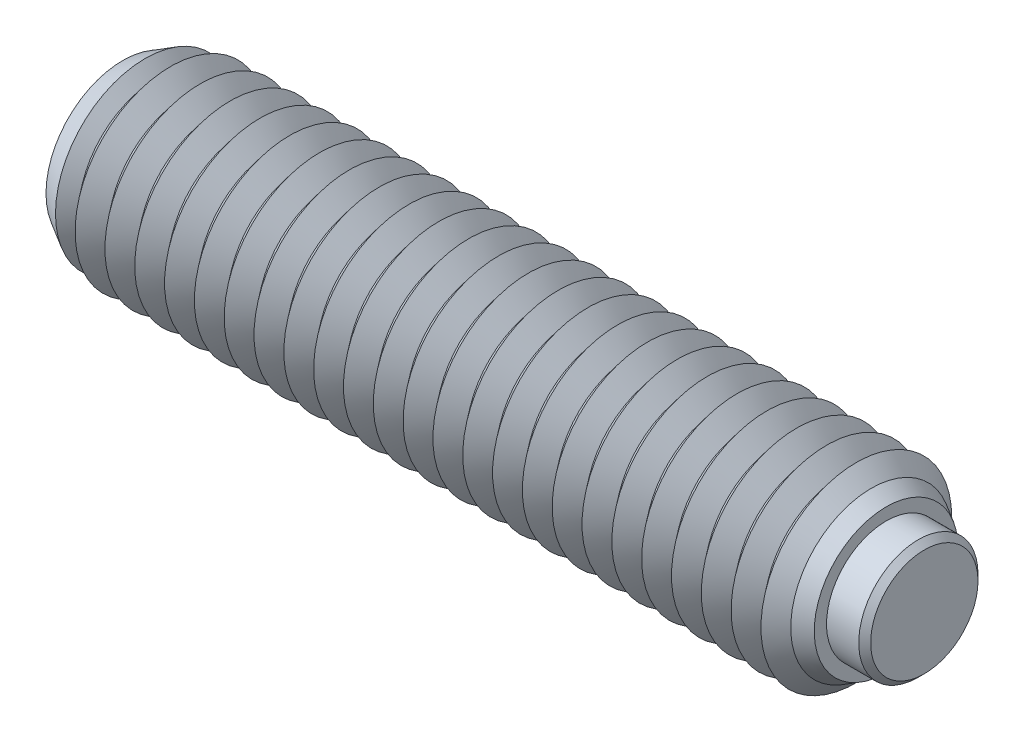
ISO-10303-21;
HEADER;
FILE_DESCRIPTION(('STEP AP214'),'2;1');
FILE_NAME('part.step','',(''),(''),'','','');
FILE_SCHEMA(('AUTOMOTIVE_DESIGN { 1 0 10303 214 1 1 1 1 }'));
ENDSEC;
DATA;
#1=APPLICATION_CONTEXT('core data for automotive mechanical design processes');
#2=APPLICATION_PROTOCOL_DEFINITION('international standard','automotive_design',2000,#1);
#3=PRODUCT_CONTEXT('',#1,'mechanical');
#4=PRODUCT('Part','Part','',(#3));
#5=PRODUCT_RELATED_PRODUCT_CATEGORY('part','',(#4));
#6=PRODUCT_DEFINITION_FORMATION('','',#4);
#7=PRODUCT_DEFINITION_CONTEXT('part definition',#1,'design');
#8=PRODUCT_DEFINITION('design','',#6,#7);
#9=PRODUCT_DEFINITION_SHAPE('','',#8);
#10=(LENGTH_UNIT() NAMED_UNIT(*) SI_UNIT(.MILLI.,.METRE.));
#11=(NAMED_UNIT(*) PLANE_ANGLE_UNIT() SI_UNIT($,.RADIAN.));
#12=(NAMED_UNIT(*) SI_UNIT($,.STERADIAN.) SOLID_ANGLE_UNIT());
#13=UNCERTAINTY_MEASURE_WITH_UNIT(LENGTH_MEASURE(1.E-05),#10,'distance_accuracy_value','');
#14=(GEOMETRIC_REPRESENTATION_CONTEXT(3) GLOBAL_UNCERTAINTY_ASSIGNED_CONTEXT((#13)) GLOBAL_UNIT_ASSIGNED_CONTEXT((#10,
#11,#12)) REPRESENTATION_CONTEXT('',''));
#15=CARTESIAN_POINT('',(0.,0.,0.));
#16=DIRECTION('',(0.,0.,1.));
#17=DIRECTION('',(1.,0.,0.));
#18=AXIS2_PLACEMENT_3D('',#15,#16,#17);
#19=CARTESIAN_POINT('',(2.225,0.,0.));
#20=DIRECTION('',(-1.,0.,0.));
#21=DIRECTION('',(0.,0.,1.));
#22=AXIS2_PLACEMENT_3D('',#19,#20,#21);
#23=CYLINDRICAL_SURFACE('',#22,2.5);
#24=CARTESIAN_POINT('',(1.975,0.,0.));
#25=DIRECTION('',(1.,0.,0.));
#26=DIRECTION('',(0.,0.,-1.));
#27=AXIS2_PLACEMENT_3D('',#24,#25,#26);
#28=CIRCLE('',#27,2.5);
#29=CARTESIAN_POINT('',(1.975,0.,-2.5));
#30=VERTEX_POINT('',#29);
#31=EDGE_CURVE('P0_E10',#30,#30,#28,.F.);
#32=ORIENTED_EDGE('',*,*,#31,.T.);
#33=EDGE_LOOP('',(#32));
#34=FACE_BOUND('',#33,.T.);
#35=CARTESIAN_POINT('',(-0.975,0.,0.));
#36=DIRECTION('',(1.,0.,0.));
#37=DIRECTION('',(0.,0.,-1.));
#38=AXIS2_PLACEMENT_3D('',#35,#36,#37);
#39=CIRCLE('',#38,2.5);
#40=CARTESIAN_POINT('',(-0.975,0.,-2.5));
#41=VERTEX_POINT('',#40);
#42=EDGE_CURVE('P0_E25',#41,#41,#39,.T.);
#43=ORIENTED_EDGE('',*,*,#42,.T.);
#44=EDGE_LOOP('',(#43));
#45=FACE_BOUND('',#44,.T.);
#46=ADVANCED_FACE('P0_F14',(#34,#45),#23,.T.);
#47=CARTESIAN_POINT('',(2.225,0.,0.));
#48=DIRECTION('',(1.,0.,0.));
#49=DIRECTION('',(0.,0.,-1.));
#50=AXIS2_PLACEMENT_3D('',#47,#48,#49);
#51=PLANE('',#50);
#52=CARTESIAN_POINT('',(2.225,0.,0.));
#53=DIRECTION('',(1.,0.,0.));
#54=DIRECTION('',(0.,0.,-1.));
#55=AXIS2_PLACEMENT_3D('',#52,#53,#54);
#56=CIRCLE('',#55,2.25);
#57=CARTESIAN_POINT('',(2.225,0.,-2.25));
#58=VERTEX_POINT('',#57);
#59=EDGE_CURVE('P0_E21',#58,#58,#56,.T.);
#60=ORIENTED_EDGE('',*,*,#59,.T.);
#61=EDGE_LOOP('',(#60));
#62=FACE_BOUND('',#61,.T.);
#63=ADVANCED_FACE('P0_F35',(#62),#51,.T.);
#64=CARTESIAN_POINT('',(-0.975,0.,0.));
#65=DIRECTION('',(1.,0.,0.));
#66=DIRECTION('',(0.,0.,-1.));
#67=AXIS2_PLACEMENT_3D('',#64,#65,#66);
#68=PLANE('',#67);
#69=ORIENTED_EDGE('',*,*,#42,.F.);
#70=EDGE_LOOP('',(#69));
#71=FACE_BOUND('',#70,.T.);
#72=ADVANCED_FACE('P0_F33',(#71),#68,.F.);
#73=CARTESIAN_POINT('',(2.225,0.,0.));
#74=DIRECTION('',(-1.,0.,0.));
#75=DIRECTION('',(0.,0.,1.));
#76=AXIS2_PLACEMENT_3D('',#73,#74,#75);
#77=CONICAL_SURFACE('',#76,2.25,0.785398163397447);
#78=ORIENTED_EDGE('',*,*,#31,.F.);
#79=EDGE_LOOP('',(#78));
#80=FACE_BOUND('',#79,.T.);
#81=ORIENTED_EDGE('',*,*,#59,.F.);
#82=EDGE_LOOP('',(#81));
#83=FACE_BOUND('',#82,.T.);
#84=ADVANCED_FACE('P0_F16',(#80,#83),#77,.T.);
#85=CLOSED_SHELL('',(#46,#63,#72,#84));
#86=MANIFOLD_SOLID_BREP('P0_B1',#85);
#87=CARTESIAN_POINT('',(-30.625,0.,0.));
#88=DIRECTION('',(-1.,0.,0.));
#89=DIRECTION('',(0.,0.,1.));
#90=AXIS2_PLACEMENT_3D('',#87,#88,#89);
#91=CONICAL_SURFACE('',#90,4.,0.895664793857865);
#92=CARTESIAN_POINT('',(-30.,0.,0.));
#93=DIRECTION('',(1.,0.,0.));
#94=DIRECTION('',(0.,0.,-1.));
#95=AXIS2_PLACEMENT_3D('',#92,#93,#94);
#96=CIRCLE('',#95,3.2193752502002);
#97=CARTESIAN_POINT('',(-30.,0.,-3.2193752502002));
#98=VERTEX_POINT('',#97);
#99=EDGE_CURVE('P1_E1113',#98,#98,#96,.T.);
#100=ORIENTED_EDGE('',*,*,#99,.F.);
#101=EDGE_LOOP('',(#100));
#102=FACE_BOUND('',#101,.T.);
#103=CARTESIAN_POINT('',(-30.4346684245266,0.,0.));
#104=DIRECTION('',(1.,0.,0.));
#105=DIRECTION('',(0.,0.,-1.));
#106=AXIS2_PLACEMENT_3D('',#103,#104,#105);
#107=CIRCLE('',#106,3.76227593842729);
#108=CARTESIAN_POINT('',(-30.4346684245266,0.,-3.76227593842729));
#109=VERTEX_POINT('',#108);
#110=EDGE_CURVE('P1_E1116',#109,#109,#107,.F.);
#111=ORIENTED_EDGE('',*,*,#110,.F.);
#112=EDGE_LOOP('',(#111));
#113=FACE_BOUND('',#112,.T.);
#114=ADVANCED_FACE('P1_F15',(#102,#113),#91,.T.);
#115=CARTESIAN_POINT('',(-1.25000000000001,0.,0.));
#116=DIRECTION('',(1.,0.,0.));
#117=DIRECTION('',(0.,0.,-1.));
#118=AXIS2_PLACEMENT_3D('',#115,#116,#117);
#119=CONICAL_SURFACE('',#118,3.2193752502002,0.895664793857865);
#120=CARTESIAN_POINT('',(-0.625000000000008,0.,0.));
#121=DIRECTION('',(1.,0.,0.));
#122=DIRECTION('',(0.,0.,-1.));
#123=AXIS2_PLACEMENT_3D('',#120,#121,#122);
#124=CIRCLE('',#123,4.);
#125=CARTESIAN_POINT('',(-0.625000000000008,0.,-4.));
#126=VERTEX_POINT('',#125);
#127=EDGE_CURVE('P1_E971',#126,#126,#124,.T.);
#128=ORIENTED_EDGE('',*,*,#127,.F.);
#129=EDGE_LOOP('',(#128));
#130=FACE_BOUND('',#129,.T.);
#131=CARTESIAN_POINT('',(-1.25000000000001,0.,0.));
#132=DIRECTION('',(1.,0.,0.));
#133=DIRECTION('',(0.,0.,-1.));
#134=AXIS2_PLACEMENT_3D('',#131,#132,#133);
#135=CIRCLE('',#134,3.2193752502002);
#136=CARTESIAN_POINT('',(-1.25000000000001,0.,-3.2193752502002));
#137=VERTEX_POINT('',#136);
#138=EDGE_CURVE('P1_E972',#137,#137,#135,.T.);
#139=ORIENTED_EDGE('',*,*,#138,.T.);
#140=EDGE_LOOP('',(#139));
#141=FACE_BOUND('',#140,.T.);
#142=ADVANCED_FACE('P1_F222',(#130,#141),#119,.T.);
#143=CARTESIAN_POINT('',(-1.87500000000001,0.,0.));
#144=DIRECTION('',(-1.,0.,0.));
#145=DIRECTION('',(0.,0.,1.));
#146=AXIS2_PLACEMENT_3D('',#143,#144,#145);
#147=CONICAL_SURFACE('',#146,4.,0.895664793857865);
#148=ORIENTED_EDGE('',*,*,#138,.F.);
#149=EDGE_LOOP('',(#148));
#150=FACE_BOUND('',#149,.T.);
#151=CARTESIAN_POINT('',(-1.87500000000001,0.,0.));
#152=DIRECTION('',(1.,0.,0.));
#153=DIRECTION('',(0.,0.,-1.));
#154=AXIS2_PLACEMENT_3D('',#151,#152,#153);
#155=CIRCLE('',#154,4.);
#156=CARTESIAN_POINT('',(-1.87500000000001,0.,-4.));
#157=VERTEX_POINT('',#156);
#158=EDGE_CURVE('P1_E976',#157,#157,#155,.T.);
#159=ORIENTED_EDGE('',*,*,#158,.T.);
#160=EDGE_LOOP('',(#159));
#161=FACE_BOUND('',#160,.T.);
#162=ADVANCED_FACE('P1_F227',(#150,#161),#147,.T.);
#163=CARTESIAN_POINT('',(-0.975,0.,0.));
#164=DIRECTION('',(1.,0.,0.));
#165=DIRECTION('',(0.,1.,0.));
#166=AXIS2_PLACEMENT_3D('',#163,#164,#165);
#167=PLANE('',#166);
#168=CARTESIAN_POINT('',(-0.975,0.,0.));
#169=DIRECTION('',(1.,0.,0.));
#170=DIRECTION('',(0.,1.,0.));
#171=AXIS2_PLACEMENT_3D('',#168,#169,#170);
#172=CIRCLE('',#171,2.5);
#173=CARTESIAN_POINT('',(-0.975,2.5,0.));
#174=VERTEX_POINT('',#173);
#175=EDGE_CURVE('P1_E486',#174,#174,#172,.T.);
#176=ORIENTED_EDGE('',*,*,#175,.T.);
#177=EDGE_LOOP('',(#176));
#178=FACE_BOUND('',#177,.T.);
#179=ADVANCED_FACE('P1_F413',(#178),#167,.T.);
#180=CARTESIAN_POINT('',(-0.975,0.,0.));
#181=DIRECTION('',(1.,0.,0.));
#182=DIRECTION('',(0.,1.,0.));
#183=AXIS2_PLACEMENT_3D('',#180,#181,#182);
#184=CYLINDRICAL_SURFACE('',#183,2.5);
#185=ORIENTED_EDGE('',*,*,#175,.F.);
#186=EDGE_LOOP('',(#185));
#187=FACE_BOUND('',#186,.T.);
#188=CARTESIAN_POINT('',(0.625,0.,0.));
#189=DIRECTION('',(1.,0.,0.));
#190=DIRECTION('',(0.,1.,0.));
#191=AXIS2_PLACEMENT_3D('',#188,#189,#190);
#192=CIRCLE('',#191,2.5);
#193=CARTESIAN_POINT('',(0.625,2.5,0.));
#194=VERTEX_POINT('',#193);
#195=EDGE_CURVE('P1_E489',#194,#194,#192,.T.);
#196=ORIENTED_EDGE('',*,*,#195,.T.);
#197=EDGE_LOOP('',(#196));
#198=FACE_BOUND('',#197,.T.);
#199=ADVANCED_FACE('P1_F209',(#187,#198),#184,.F.);
#200=CARTESIAN_POINT('',(0.625,3.01415608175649,0.));
#201=DIRECTION('',(1.,0.,0.));
#202=DIRECTION('',(0.,1.,0.));
#203=AXIS2_PLACEMENT_3D('',#200,#201,#202);
#204=PLANE('',#203);
#205=ORIENTED_EDGE('',*,*,#195,.F.);
#206=EDGE_LOOP('',(#205));
#207=FACE_BOUND('',#206,.T.);
#208=CARTESIAN_POINT('',(0.625,0.,0.));
#209=DIRECTION('',(1.,0.,0.));
#210=DIRECTION('',(0.,1.,0.));
#211=AXIS2_PLACEMENT_3D('',#208,#209,#210);
#212=CIRCLE('',#211,3.01415608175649);
#213=CARTESIAN_POINT('',(0.625,3.01415608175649,0.));
#214=VERTEX_POINT('',#213);
#215=EDGE_CURVE('P1_E121',#214,#214,#212,.T.);
#216=ORIENTED_EDGE('',*,*,#215,.T.);
#217=EDGE_LOOP('',(#216));
#218=FACE_BOUND('',#217,.T.);
#219=ADVANCED_FACE('P1_F206',(#207,#218),#204,.T.);
#220=CARTESIAN_POINT('',(0.625,0.,0.));
#221=DIRECTION('',(-1.,0.,0.));
#222=DIRECTION('',(0.,-1.,0.));
#223=AXIS2_PLACEMENT_3D('',#220,#221,#222);
#224=CONICAL_SURFACE('',#223,3.01415608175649,0.523598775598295);
#225=CARTESIAN_POINT('',(0.,0.,0.));
#226=DIRECTION('',(1.,0.,0.));
#227=DIRECTION('',(0.,0.,-1.));
#228=AXIS2_PLACEMENT_3D('',#225,#226,#227);
#229=CIRCLE('',#228,3.375);
#230=CARTESIAN_POINT('',(0.,0.,-3.375));
#231=VERTEX_POINT('',#230);
#232=EDGE_CURVE('P1_E477',#231,#231,#229,.T.);
#233=ORIENTED_EDGE('',*,*,#232,.T.);
#234=EDGE_LOOP('',(#233));
#235=FACE_BOUND('',#234,.T.);
#236=ORIENTED_EDGE('',*,*,#215,.F.);
#237=EDGE_LOOP('',(#236));
#238=FACE_BOUND('',#237,.T.);
#239=ADVANCED_FACE('P1_F203',(#235,#238),#224,.T.);
#240=CARTESIAN_POINT('',(0.,0.,0.));
#241=DIRECTION('',(-1.,0.,0.));
#242=DIRECTION('',(0.,0.,1.));
#243=AXIS2_PLACEMENT_3D('',#240,#241,#242);
#244=CONICAL_SURFACE('',#243,3.375,0.785398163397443);
#245=ORIENTED_EDGE('',*,*,#127,.T.);
#246=EDGE_LOOP('',(#245));
#247=FACE_BOUND('',#246,.T.);
#248=ORIENTED_EDGE('',*,*,#232,.F.);
#249=EDGE_LOOP('',(#248));
#250=FACE_BOUND('',#249,.T.);
#251=ADVANCED_FACE('P1_F17',(#247,#250),#244,.T.);
#252=CARTESIAN_POINT('',(-2.50000000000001,0.,0.));
#253=DIRECTION('',(1.,0.,0.));
#254=DIRECTION('',(0.,0.,-1.));
#255=AXIS2_PLACEMENT_3D('',#252,#253,#254);
#256=CONICAL_SURFACE('',#255,3.2193752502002,0.895664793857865);
#257=ORIENTED_EDGE('',*,*,#158,.F.);
#258=EDGE_LOOP('',(#257));
#259=FACE_BOUND('',#258,.T.);
#260=CARTESIAN_POINT('',(-2.50000000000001,0.,0.));
#261=DIRECTION('',(1.,0.,0.));
#262=DIRECTION('',(0.,0.,-1.));
#263=AXIS2_PLACEMENT_3D('',#260,#261,#262);
#264=CIRCLE('',#263,3.2193752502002);
#265=CARTESIAN_POINT('',(-2.50000000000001,0.,-3.2193752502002));
#266=VERTEX_POINT('',#265);
#267=EDGE_CURVE('P1_E981',#266,#266,#264,.T.);
#268=ORIENTED_EDGE('',*,*,#267,.T.);
#269=EDGE_LOOP('',(#268));
#270=FACE_BOUND('',#269,.T.);
#271=ADVANCED_FACE('P1_F407',(#259,#270),#256,.T.);
#272=CARTESIAN_POINT('',(-3.12500000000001,0.,0.));
#273=DIRECTION('',(-1.,0.,0.));
#274=DIRECTION('',(0.,0.,1.));
#275=AXIS2_PLACEMENT_3D('',#272,#273,#274);
#276=CONICAL_SURFACE('',#275,4.,0.895664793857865);
#277=ORIENTED_EDGE('',*,*,#267,.F.);
#278=EDGE_LOOP('',(#277));
#279=FACE_BOUND('',#278,.T.);
#280=CARTESIAN_POINT('',(-3.12500000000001,0.,0.));
#281=DIRECTION('',(1.,0.,0.));
#282=DIRECTION('',(0.,0.,-1.));
#283=AXIS2_PLACEMENT_3D('',#280,#281,#282);
#284=CIRCLE('',#283,4.);
#285=CARTESIAN_POINT('',(-3.12500000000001,0.,-4.));
#286=VERTEX_POINT('',#285);
#287=EDGE_CURVE('P1_E984',#286,#286,#284,.T.);
#288=ORIENTED_EDGE('',*,*,#287,.T.);
#289=EDGE_LOOP('',(#288));
#290=FACE_BOUND('',#289,.T.);
#291=ADVANCED_FACE('P1_F403',(#279,#290),#276,.T.);
#292=CARTESIAN_POINT('',(-3.75000000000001,0.,0.));
#293=DIRECTION('',(1.,0.,0.));
#294=DIRECTION('',(0.,0.,-1.));
#295=AXIS2_PLACEMENT_3D('',#292,#293,#294);
#296=CONICAL_SURFACE('',#295,3.2193752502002,0.895664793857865);
#297=ORIENTED_EDGE('',*,*,#287,.F.);
#298=EDGE_LOOP('',(#297));
#299=FACE_BOUND('',#298,.T.);
#300=CARTESIAN_POINT('',(-3.75000000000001,0.,0.));
#301=DIRECTION('',(1.,0.,0.));
#302=DIRECTION('',(0.,0.,-1.));
#303=AXIS2_PLACEMENT_3D('',#300,#301,#302);
#304=CIRCLE('',#303,3.2193752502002);
#305=CARTESIAN_POINT('',(-3.75000000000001,0.,-3.2193752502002));
#306=VERTEX_POINT('',#305);
#307=EDGE_CURVE('P1_E987',#306,#306,#304,.T.);
#308=ORIENTED_EDGE('',*,*,#307,.T.);
#309=EDGE_LOOP('',(#308));
#310=FACE_BOUND('',#309,.T.);
#311=ADVANCED_FACE('P1_F399',(#299,#310),#296,.T.);
#312=CARTESIAN_POINT('',(-4.37500000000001,0.,0.));
#313=DIRECTION('',(-1.,0.,0.));
#314=DIRECTION('',(0.,0.,1.));
#315=AXIS2_PLACEMENT_3D('',#312,#313,#314);
#316=CONICAL_SURFACE('',#315,4.,0.895664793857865);
#317=ORIENTED_EDGE('',*,*,#307,.F.);
#318=EDGE_LOOP('',(#317));
#319=FACE_BOUND('',#318,.T.);
#320=CARTESIAN_POINT('',(-4.37500000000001,0.,0.));
#321=DIRECTION('',(1.,0.,0.));
#322=DIRECTION('',(0.,0.,-1.));
#323=AXIS2_PLACEMENT_3D('',#320,#321,#322);
#324=CIRCLE('',#323,4.);
#325=CARTESIAN_POINT('',(-4.37500000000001,0.,-4.));
#326=VERTEX_POINT('',#325);
#327=EDGE_CURVE('P1_E990',#326,#326,#324,.T.);
#328=ORIENTED_EDGE('',*,*,#327,.T.);
#329=EDGE_LOOP('',(#328));
#330=FACE_BOUND('',#329,.T.);
#331=ADVANCED_FACE('P1_F395',(#319,#330),#316,.T.);
#332=CARTESIAN_POINT('',(-5.00000000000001,0.,0.));
#333=DIRECTION('',(1.,0.,0.));
#334=DIRECTION('',(0.,0.,-1.));
#335=AXIS2_PLACEMENT_3D('',#332,#333,#334);
#336=CONICAL_SURFACE('',#335,3.2193752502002,0.895664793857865);
#337=ORIENTED_EDGE('',*,*,#327,.F.);
#338=EDGE_LOOP('',(#337));
#339=FACE_BOUND('',#338,.T.);
#340=CARTESIAN_POINT('',(-5.00000000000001,0.,0.));
#341=DIRECTION('',(1.,0.,0.));
#342=DIRECTION('',(0.,0.,-1.));
#343=AXIS2_PLACEMENT_3D('',#340,#341,#342);
#344=CIRCLE('',#343,3.2193752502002);
#345=CARTESIAN_POINT('',(-5.00000000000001,0.,-3.2193752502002));
#346=VERTEX_POINT('',#345);
#347=EDGE_CURVE('P1_E993',#346,#346,#344,.T.);
#348=ORIENTED_EDGE('',*,*,#347,.T.);
#349=EDGE_LOOP('',(#348));
#350=FACE_BOUND('',#349,.T.);
#351=ADVANCED_FACE('P1_F391',(#339,#350),#336,.T.);
#352=CARTESIAN_POINT('',(-5.62500000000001,0.,0.));
#353=DIRECTION('',(-1.,0.,0.));
#354=DIRECTION('',(0.,0.,1.));
#355=AXIS2_PLACEMENT_3D('',#352,#353,#354);
#356=CONICAL_SURFACE('',#355,4.,0.895664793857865);
#357=ORIENTED_EDGE('',*,*,#347,.F.);
#358=EDGE_LOOP('',(#357));
#359=FACE_BOUND('',#358,.T.);
#360=CARTESIAN_POINT('',(-5.62500000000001,0.,0.));
#361=DIRECTION('',(1.,0.,0.));
#362=DIRECTION('',(0.,0.,-1.));
#363=AXIS2_PLACEMENT_3D('',#360,#361,#362);
#364=CIRCLE('',#363,4.);
#365=CARTESIAN_POINT('',(-5.62500000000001,0.,-4.));
#366=VERTEX_POINT('',#365);
#367=EDGE_CURVE('P1_E996',#366,#366,#364,.T.);
#368=ORIENTED_EDGE('',*,*,#367,.T.);
#369=EDGE_LOOP('',(#368));
#370=FACE_BOUND('',#369,.T.);
#371=ADVANCED_FACE('P1_F387',(#359,#370),#356,.T.);
#372=CARTESIAN_POINT('',(-6.25000000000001,0.,0.));
#373=DIRECTION('',(1.,0.,0.));
#374=DIRECTION('',(0.,0.,-1.));
#375=AXIS2_PLACEMENT_3D('',#372,#373,#374);
#376=CONICAL_SURFACE('',#375,3.2193752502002,0.895664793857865);
#377=ORIENTED_EDGE('',*,*,#367,.F.);
#378=EDGE_LOOP('',(#377));
#379=FACE_BOUND('',#378,.T.);
#380=CARTESIAN_POINT('',(-6.25000000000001,0.,0.));
#381=DIRECTION('',(1.,0.,0.));
#382=DIRECTION('',(0.,0.,-1.));
#383=AXIS2_PLACEMENT_3D('',#380,#381,#382);
#384=CIRCLE('',#383,3.2193752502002);
#385=CARTESIAN_POINT('',(-6.25000000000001,0.,-3.2193752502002));
#386=VERTEX_POINT('',#385);
#387=EDGE_CURVE('P1_E999',#386,#386,#384,.T.);
#388=ORIENTED_EDGE('',*,*,#387,.T.);
#389=EDGE_LOOP('',(#388));
#390=FACE_BOUND('',#389,.T.);
#391=ADVANCED_FACE('P1_F383',(#379,#390),#376,.T.);
#392=CARTESIAN_POINT('',(-6.87500000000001,0.,0.));
#393=DIRECTION('',(-1.,0.,0.));
#394=DIRECTION('',(0.,0.,1.));
#395=AXIS2_PLACEMENT_3D('',#392,#393,#394);
#396=CONICAL_SURFACE('',#395,4.,0.895664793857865);
#397=ORIENTED_EDGE('',*,*,#387,.F.);
#398=EDGE_LOOP('',(#397));
#399=FACE_BOUND('',#398,.T.);
#400=CARTESIAN_POINT('',(-6.87500000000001,0.,0.));
#401=DIRECTION('',(1.,0.,0.));
#402=DIRECTION('',(0.,0.,-1.));
#403=AXIS2_PLACEMENT_3D('',#400,#401,#402);
#404=CIRCLE('',#403,4.);
#405=CARTESIAN_POINT('',(-6.87500000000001,0.,-4.));
#406=VERTEX_POINT('',#405);
#407=EDGE_CURVE('P1_E1002',#406,#406,#404,.T.);
#408=ORIENTED_EDGE('',*,*,#407,.T.);
#409=EDGE_LOOP('',(#408));
#410=FACE_BOUND('',#409,.T.);
#411=ADVANCED_FACE('P1_F379',(#399,#410),#396,.T.);
#412=CARTESIAN_POINT('',(-7.50000000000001,0.,0.));
#413=DIRECTION('',(1.,0.,0.));
#414=DIRECTION('',(0.,0.,-1.));
#415=AXIS2_PLACEMENT_3D('',#412,#413,#414);
#416=CONICAL_SURFACE('',#415,3.2193752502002,0.895664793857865);
#417=ORIENTED_EDGE('',*,*,#407,.F.);
#418=EDGE_LOOP('',(#417));
#419=FACE_BOUND('',#418,.T.);
#420=CARTESIAN_POINT('',(-7.50000000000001,0.,0.));
#421=DIRECTION('',(1.,0.,0.));
#422=DIRECTION('',(0.,0.,-1.));
#423=AXIS2_PLACEMENT_3D('',#420,#421,#422);
#424=CIRCLE('',#423,3.2193752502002);
#425=CARTESIAN_POINT('',(-7.50000000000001,0.,-3.2193752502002));
#426=VERTEX_POINT('',#425);
#427=EDGE_CURVE('P1_E1005',#426,#426,#424,.T.);
#428=ORIENTED_EDGE('',*,*,#427,.T.);
#429=EDGE_LOOP('',(#428));
#430=FACE_BOUND('',#429,.T.);
#431=ADVANCED_FACE('P1_F375',(#419,#430),#416,.T.);
#432=CARTESIAN_POINT('',(-8.12500000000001,0.,0.));
#433=DIRECTION('',(-1.,0.,0.));
#434=DIRECTION('',(0.,0.,1.));
#435=AXIS2_PLACEMENT_3D('',#432,#433,#434);
#436=CONICAL_SURFACE('',#435,4.,0.895664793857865);
#437=ORIENTED_EDGE('',*,*,#427,.F.);
#438=EDGE_LOOP('',(#437));
#439=FACE_BOUND('',#438,.T.);
#440=CARTESIAN_POINT('',(-8.12500000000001,0.,0.));
#441=DIRECTION('',(1.,0.,0.));
#442=DIRECTION('',(0.,0.,-1.));
#443=AXIS2_PLACEMENT_3D('',#440,#441,#442);
#444=CIRCLE('',#443,4.);
#445=CARTESIAN_POINT('',(-8.12500000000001,0.,-4.));
#446=VERTEX_POINT('',#445);
#447=EDGE_CURVE('P1_E1008',#446,#446,#444,.T.);
#448=ORIENTED_EDGE('',*,*,#447,.T.);
#449=EDGE_LOOP('',(#448));
#450=FACE_BOUND('',#449,.T.);
#451=ADVANCED_FACE('P1_F371',(#439,#450),#436,.T.);
#452=CARTESIAN_POINT('',(-8.75000000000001,0.,0.));
#453=DIRECTION('',(1.,0.,0.));
#454=DIRECTION('',(0.,0.,-1.));
#455=AXIS2_PLACEMENT_3D('',#452,#453,#454);
#456=CONICAL_SURFACE('',#455,3.2193752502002,0.895664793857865);
#457=ORIENTED_EDGE('',*,*,#447,.F.);
#458=EDGE_LOOP('',(#457));
#459=FACE_BOUND('',#458,.T.);
#460=CARTESIAN_POINT('',(-8.75000000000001,0.,0.));
#461=DIRECTION('',(1.,0.,0.));
#462=DIRECTION('',(0.,0.,-1.));
#463=AXIS2_PLACEMENT_3D('',#460,#461,#462);
#464=CIRCLE('',#463,3.2193752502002);
#465=CARTESIAN_POINT('',(-8.75000000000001,0.,-3.2193752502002));
#466=VERTEX_POINT('',#465);
#467=EDGE_CURVE('P1_E1011',#466,#466,#464,.T.);
#468=ORIENTED_EDGE('',*,*,#467,.T.);
#469=EDGE_LOOP('',(#468));
#470=FACE_BOUND('',#469,.T.);
#471=ADVANCED_FACE('P1_F367',(#459,#470),#456,.T.);
#472=CARTESIAN_POINT('',(-9.37500000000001,0.,0.));
#473=DIRECTION('',(-1.,0.,0.));
#474=DIRECTION('',(0.,0.,1.));
#475=AXIS2_PLACEMENT_3D('',#472,#473,#474);
#476=CONICAL_SURFACE('',#475,4.,0.895664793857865);
#477=ORIENTED_EDGE('',*,*,#467,.F.);
#478=EDGE_LOOP('',(#477));
#479=FACE_BOUND('',#478,.T.);
#480=CARTESIAN_POINT('',(-9.37500000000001,0.,0.));
#481=DIRECTION('',(1.,0.,0.));
#482=DIRECTION('',(0.,0.,-1.));
#483=AXIS2_PLACEMENT_3D('',#480,#481,#482);
#484=CIRCLE('',#483,4.);
#485=CARTESIAN_POINT('',(-9.37500000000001,0.,-4.));
#486=VERTEX_POINT('',#485);
#487=EDGE_CURVE('P1_E1014',#486,#486,#484,.T.);
#488=ORIENTED_EDGE('',*,*,#487,.T.);
#489=EDGE_LOOP('',(#488));
#490=FACE_BOUND('',#489,.T.);
#491=ADVANCED_FACE('P1_F363',(#479,#490),#476,.T.);
#492=CARTESIAN_POINT('',(-10.,0.,0.));
#493=DIRECTION('',(1.,0.,0.));
#494=DIRECTION('',(0.,0.,-1.));
#495=AXIS2_PLACEMENT_3D('',#492,#493,#494);
#496=CONICAL_SURFACE('',#495,3.2193752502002,0.895664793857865);
#497=ORIENTED_EDGE('',*,*,#487,.F.);
#498=EDGE_LOOP('',(#497));
#499=FACE_BOUND('',#498,.T.);
#500=CARTESIAN_POINT('',(-10.,0.,0.));
#501=DIRECTION('',(1.,0.,0.));
#502=DIRECTION('',(0.,0.,-1.));
#503=AXIS2_PLACEMENT_3D('',#500,#501,#502);
#504=CIRCLE('',#503,3.2193752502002);
#505=CARTESIAN_POINT('',(-10.,0.,-3.2193752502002));
#506=VERTEX_POINT('',#505);
#507=EDGE_CURVE('P1_E1017',#506,#506,#504,.T.);
#508=ORIENTED_EDGE('',*,*,#507,.T.);
#509=EDGE_LOOP('',(#508));
#510=FACE_BOUND('',#509,.T.);
#511=ADVANCED_FACE('P1_F359',(#499,#510),#496,.T.);
#512=CARTESIAN_POINT('',(-10.625,0.,0.));
#513=DIRECTION('',(-1.,0.,0.));
#514=DIRECTION('',(0.,0.,1.));
#515=AXIS2_PLACEMENT_3D('',#512,#513,#514);
#516=CONICAL_SURFACE('',#515,4.,0.895664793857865);
#517=ORIENTED_EDGE('',*,*,#507,.F.);
#518=EDGE_LOOP('',(#517));
#519=FACE_BOUND('',#518,.T.);
#520=CARTESIAN_POINT('',(-10.625,0.,0.));
#521=DIRECTION('',(1.,0.,0.));
#522=DIRECTION('',(0.,0.,-1.));
#523=AXIS2_PLACEMENT_3D('',#520,#521,#522);
#524=CIRCLE('',#523,4.);
#525=CARTESIAN_POINT('',(-10.625,0.,-4.));
#526=VERTEX_POINT('',#525);
#527=EDGE_CURVE('P1_E1020',#526,#526,#524,.T.);
#528=ORIENTED_EDGE('',*,*,#527,.T.);
#529=EDGE_LOOP('',(#528));
#530=FACE_BOUND('',#529,.T.);
#531=ADVANCED_FACE('P1_F355',(#519,#530),#516,.T.);
#532=CARTESIAN_POINT('',(-11.25,0.,0.));
#533=DIRECTION('',(1.,0.,0.));
#534=DIRECTION('',(0.,0.,-1.));
#535=AXIS2_PLACEMENT_3D('',#532,#533,#534);
#536=CONICAL_SURFACE('',#535,3.2193752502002,0.895664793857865);
#537=ORIENTED_EDGE('',*,*,#527,.F.);
#538=EDGE_LOOP('',(#537));
#539=FACE_BOUND('',#538,.T.);
#540=CARTESIAN_POINT('',(-11.25,0.,0.));
#541=DIRECTION('',(1.,0.,0.));
#542=DIRECTION('',(0.,0.,-1.));
#543=AXIS2_PLACEMENT_3D('',#540,#541,#542);
#544=CIRCLE('',#543,3.2193752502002);
#545=CARTESIAN_POINT('',(-11.25,0.,-3.2193752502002));
#546=VERTEX_POINT('',#545);
#547=EDGE_CURVE('P1_E1023',#546,#546,#544,.T.);
#548=ORIENTED_EDGE('',*,*,#547,.T.);
#549=EDGE_LOOP('',(#548));
#550=FACE_BOUND('',#549,.T.);
#551=ADVANCED_FACE('P1_F351',(#539,#550),#536,.T.);
#552=CARTESIAN_POINT('',(-11.875,0.,0.));
#553=DIRECTION('',(-1.,0.,0.));
#554=DIRECTION('',(0.,0.,1.));
#555=AXIS2_PLACEMENT_3D('',#552,#553,#554);
#556=CONICAL_SURFACE('',#555,4.,0.895664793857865);
#557=ORIENTED_EDGE('',*,*,#547,.F.);
#558=EDGE_LOOP('',(#557));
#559=FACE_BOUND('',#558,.T.);
#560=CARTESIAN_POINT('',(-11.875,0.,0.));
#561=DIRECTION('',(1.,0.,0.));
#562=DIRECTION('',(0.,0.,-1.));
#563=AXIS2_PLACEMENT_3D('',#560,#561,#562);
#564=CIRCLE('',#563,4.);
#565=CARTESIAN_POINT('',(-11.875,0.,-4.));
#566=VERTEX_POINT('',#565);
#567=EDGE_CURVE('P1_E1026',#566,#566,#564,.T.);
#568=ORIENTED_EDGE('',*,*,#567,.T.);
#569=EDGE_LOOP('',(#568));
#570=FACE_BOUND('',#569,.T.);
#571=ADVANCED_FACE('P1_F347',(#559,#570),#556,.T.);
#572=CARTESIAN_POINT('',(-12.5,0.,0.));
#573=DIRECTION('',(1.,0.,0.));
#574=DIRECTION('',(0.,0.,-1.));
#575=AXIS2_PLACEMENT_3D('',#572,#573,#574);
#576=CONICAL_SURFACE('',#575,3.2193752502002,0.895664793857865);
#577=ORIENTED_EDGE('',*,*,#567,.F.);
#578=EDGE_LOOP('',(#577));
#579=FACE_BOUND('',#578,.T.);
#580=CARTESIAN_POINT('',(-12.5,0.,0.));
#581=DIRECTION('',(1.,0.,0.));
#582=DIRECTION('',(0.,0.,-1.));
#583=AXIS2_PLACEMENT_3D('',#580,#581,#582);
#584=CIRCLE('',#583,3.2193752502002);
#585=CARTESIAN_POINT('',(-12.5,0.,-3.2193752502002));
#586=VERTEX_POINT('',#585);
#587=EDGE_CURVE('P1_E1029',#586,#586,#584,.T.);
#588=ORIENTED_EDGE('',*,*,#587,.T.);
#589=EDGE_LOOP('',(#588));
#590=FACE_BOUND('',#589,.T.);
#591=ADVANCED_FACE('P1_F343',(#579,#590),#576,.T.);
#592=CARTESIAN_POINT('',(-13.125,0.,0.));
#593=DIRECTION('',(-1.,0.,0.));
#594=DIRECTION('',(0.,0.,1.));
#595=AXIS2_PLACEMENT_3D('',#592,#593,#594);
#596=CONICAL_SURFACE('',#595,4.,0.895664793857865);
#597=ORIENTED_EDGE('',*,*,#587,.F.);
#598=EDGE_LOOP('',(#597));
#599=FACE_BOUND('',#598,.T.);
#600=CARTESIAN_POINT('',(-13.125,0.,0.));
#601=DIRECTION('',(1.,0.,0.));
#602=DIRECTION('',(0.,0.,-1.));
#603=AXIS2_PLACEMENT_3D('',#600,#601,#602);
#604=CIRCLE('',#603,4.);
#605=CARTESIAN_POINT('',(-13.125,0.,-4.));
#606=VERTEX_POINT('',#605);
#607=EDGE_CURVE('P1_E1032',#606,#606,#604,.T.);
#608=ORIENTED_EDGE('',*,*,#607,.T.);
#609=EDGE_LOOP('',(#608));
#610=FACE_BOUND('',#609,.T.);
#611=ADVANCED_FACE('P1_F339',(#599,#610),#596,.T.);
#612=CARTESIAN_POINT('',(-13.75,0.,0.));
#613=DIRECTION('',(1.,0.,0.));
#614=DIRECTION('',(0.,0.,-1.));
#615=AXIS2_PLACEMENT_3D('',#612,#613,#614);
#616=CONICAL_SURFACE('',#615,3.2193752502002,0.895664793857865);
#617=ORIENTED_EDGE('',*,*,#607,.F.);
#618=EDGE_LOOP('',(#617));
#619=FACE_BOUND('',#618,.T.);
#620=CARTESIAN_POINT('',(-13.75,0.,0.));
#621=DIRECTION('',(1.,0.,0.));
#622=DIRECTION('',(0.,0.,-1.));
#623=AXIS2_PLACEMENT_3D('',#620,#621,#622);
#624=CIRCLE('',#623,3.2193752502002);
#625=CARTESIAN_POINT('',(-13.75,0.,-3.2193752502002));
#626=VERTEX_POINT('',#625);
#627=EDGE_CURVE('P1_E1035',#626,#626,#624,.T.);
#628=ORIENTED_EDGE('',*,*,#627,.T.);
#629=EDGE_LOOP('',(#628));
#630=FACE_BOUND('',#629,.T.);
#631=ADVANCED_FACE('P1_F335',(#619,#630),#616,.T.);
#632=CARTESIAN_POINT('',(-14.375,0.,0.));
#633=DIRECTION('',(-1.,0.,0.));
#634=DIRECTION('',(0.,0.,1.));
#635=AXIS2_PLACEMENT_3D('',#632,#633,#634);
#636=CONICAL_SURFACE('',#635,4.,0.895664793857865);
#637=ORIENTED_EDGE('',*,*,#627,.F.);
#638=EDGE_LOOP('',(#637));
#639=FACE_BOUND('',#638,.T.);
#640=CARTESIAN_POINT('',(-14.375,0.,0.));
#641=DIRECTION('',(1.,0.,0.));
#642=DIRECTION('',(0.,0.,-1.));
#643=AXIS2_PLACEMENT_3D('',#640,#641,#642);
#644=CIRCLE('',#643,4.);
#645=CARTESIAN_POINT('',(-14.375,0.,-4.));
#646=VERTEX_POINT('',#645);
#647=EDGE_CURVE('P1_E1038',#646,#646,#644,.T.);
#648=ORIENTED_EDGE('',*,*,#647,.T.);
#649=EDGE_LOOP('',(#648));
#650=FACE_BOUND('',#649,.T.);
#651=ADVANCED_FACE('P1_F331',(#639,#650),#636,.T.);
#652=CARTESIAN_POINT('',(-15.,0.,0.));
#653=DIRECTION('',(1.,0.,0.));
#654=DIRECTION('',(0.,0.,-1.));
#655=AXIS2_PLACEMENT_3D('',#652,#653,#654);
#656=CONICAL_SURFACE('',#655,3.2193752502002,0.895664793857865);
#657=ORIENTED_EDGE('',*,*,#647,.F.);
#658=EDGE_LOOP('',(#657));
#659=FACE_BOUND('',#658,.T.);
#660=CARTESIAN_POINT('',(-15.,0.,0.));
#661=DIRECTION('',(1.,0.,0.));
#662=DIRECTION('',(0.,0.,-1.));
#663=AXIS2_PLACEMENT_3D('',#660,#661,#662);
#664=CIRCLE('',#663,3.2193752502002);
#665=CARTESIAN_POINT('',(-15.,0.,-3.2193752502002));
#666=VERTEX_POINT('',#665);
#667=EDGE_CURVE('P1_E1041',#666,#666,#664,.T.);
#668=ORIENTED_EDGE('',*,*,#667,.T.);
#669=EDGE_LOOP('',(#668));
#670=FACE_BOUND('',#669,.T.);
#671=ADVANCED_FACE('P1_F327',(#659,#670),#656,.T.);
#672=CARTESIAN_POINT('',(-15.625,0.,0.));
#673=DIRECTION('',(-1.,0.,0.));
#674=DIRECTION('',(0.,0.,1.));
#675=AXIS2_PLACEMENT_3D('',#672,#673,#674);
#676=CONICAL_SURFACE('',#675,4.,0.895664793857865);
#677=ORIENTED_EDGE('',*,*,#667,.F.);
#678=EDGE_LOOP('',(#677));
#679=FACE_BOUND('',#678,.T.);
#680=CARTESIAN_POINT('',(-15.625,0.,0.));
#681=DIRECTION('',(1.,0.,0.));
#682=DIRECTION('',(0.,0.,-1.));
#683=AXIS2_PLACEMENT_3D('',#680,#681,#682);
#684=CIRCLE('',#683,4.);
#685=CARTESIAN_POINT('',(-15.625,0.,-4.));
#686=VERTEX_POINT('',#685);
#687=EDGE_CURVE('P1_E1044',#686,#686,#684,.T.);
#688=ORIENTED_EDGE('',*,*,#687,.T.);
#689=EDGE_LOOP('',(#688));
#690=FACE_BOUND('',#689,.T.);
#691=ADVANCED_FACE('P1_F323',(#679,#690),#676,.T.);
#692=CARTESIAN_POINT('',(-16.25,0.,0.));
#693=DIRECTION('',(1.,0.,0.));
#694=DIRECTION('',(0.,0.,-1.));
#695=AXIS2_PLACEMENT_3D('',#692,#693,#694);
#696=CONICAL_SURFACE('',#695,3.2193752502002,0.895664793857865);
#697=ORIENTED_EDGE('',*,*,#687,.F.);
#698=EDGE_LOOP('',(#697));
#699=FACE_BOUND('',#698,.T.);
#700=CARTESIAN_POINT('',(-16.25,0.,0.));
#701=DIRECTION('',(1.,0.,0.));
#702=DIRECTION('',(0.,0.,-1.));
#703=AXIS2_PLACEMENT_3D('',#700,#701,#702);
#704=CIRCLE('',#703,3.2193752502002);
#705=CARTESIAN_POINT('',(-16.25,0.,-3.2193752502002));
#706=VERTEX_POINT('',#705);
#707=EDGE_CURVE('P1_E1047',#706,#706,#704,.T.);
#708=ORIENTED_EDGE('',*,*,#707,.T.);
#709=EDGE_LOOP('',(#708));
#710=FACE_BOUND('',#709,.T.);
#711=ADVANCED_FACE('P1_F319',(#699,#710),#696,.T.);
#712=CARTESIAN_POINT('',(-16.875,0.,0.));
#713=DIRECTION('',(-1.,0.,0.));
#714=DIRECTION('',(0.,0.,1.));
#715=AXIS2_PLACEMENT_3D('',#712,#713,#714);
#716=CONICAL_SURFACE('',#715,4.,0.895664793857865);
#717=ORIENTED_EDGE('',*,*,#707,.F.);
#718=EDGE_LOOP('',(#717));
#719=FACE_BOUND('',#718,.T.);
#720=CARTESIAN_POINT('',(-16.875,0.,0.));
#721=DIRECTION('',(1.,0.,0.));
#722=DIRECTION('',(0.,0.,-1.));
#723=AXIS2_PLACEMENT_3D('',#720,#721,#722);
#724=CIRCLE('',#723,4.);
#725=CARTESIAN_POINT('',(-16.875,0.,-4.));
#726=VERTEX_POINT('',#725);
#727=EDGE_CURVE('P1_E1050',#726,#726,#724,.T.);
#728=ORIENTED_EDGE('',*,*,#727,.T.);
#729=EDGE_LOOP('',(#728));
#730=FACE_BOUND('',#729,.T.);
#731=ADVANCED_FACE('P1_F315',(#719,#730),#716,.T.);
#732=CARTESIAN_POINT('',(-17.5,0.,0.));
#733=DIRECTION('',(1.,0.,0.));
#734=DIRECTION('',(0.,0.,-1.));
#735=AXIS2_PLACEMENT_3D('',#732,#733,#734);
#736=CONICAL_SURFACE('',#735,3.2193752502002,0.895664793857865);
#737=ORIENTED_EDGE('',*,*,#727,.F.);
#738=EDGE_LOOP('',(#737));
#739=FACE_BOUND('',#738,.T.);
#740=CARTESIAN_POINT('',(-17.5,0.,0.));
#741=DIRECTION('',(1.,0.,0.));
#742=DIRECTION('',(0.,0.,-1.));
#743=AXIS2_PLACEMENT_3D('',#740,#741,#742);
#744=CIRCLE('',#743,3.2193752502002);
#745=CARTESIAN_POINT('',(-17.5,0.,-3.2193752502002));
#746=VERTEX_POINT('',#745);
#747=EDGE_CURVE('P1_E1053',#746,#746,#744,.T.);
#748=ORIENTED_EDGE('',*,*,#747,.T.);
#749=EDGE_LOOP('',(#748));
#750=FACE_BOUND('',#749,.T.);
#751=ADVANCED_FACE('P1_F311',(#739,#750),#736,.T.);
#752=CARTESIAN_POINT('',(-18.125,0.,0.));
#753=DIRECTION('',(-1.,0.,0.));
#754=DIRECTION('',(0.,0.,1.));
#755=AXIS2_PLACEMENT_3D('',#752,#753,#754);
#756=CONICAL_SURFACE('',#755,4.,0.895664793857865);
#757=ORIENTED_EDGE('',*,*,#747,.F.);
#758=EDGE_LOOP('',(#757));
#759=FACE_BOUND('',#758,.T.);
#760=CARTESIAN_POINT('',(-18.125,0.,0.));
#761=DIRECTION('',(1.,0.,0.));
#762=DIRECTION('',(0.,0.,-1.));
#763=AXIS2_PLACEMENT_3D('',#760,#761,#762);
#764=CIRCLE('',#763,4.);
#765=CARTESIAN_POINT('',(-18.125,0.,-4.));
#766=VERTEX_POINT('',#765);
#767=EDGE_CURVE('P1_E1056',#766,#766,#764,.T.);
#768=ORIENTED_EDGE('',*,*,#767,.T.);
#769=EDGE_LOOP('',(#768));
#770=FACE_BOUND('',#769,.T.);
#771=ADVANCED_FACE('P1_F307',(#759,#770),#756,.T.);
#772=CARTESIAN_POINT('',(-18.75,0.,0.));
#773=DIRECTION('',(1.,0.,0.));
#774=DIRECTION('',(0.,0.,-1.));
#775=AXIS2_PLACEMENT_3D('',#772,#773,#774);
#776=CONICAL_SURFACE('',#775,3.2193752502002,0.895664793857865);
#777=ORIENTED_EDGE('',*,*,#767,.F.);
#778=EDGE_LOOP('',(#777));
#779=FACE_BOUND('',#778,.T.);
#780=CARTESIAN_POINT('',(-18.75,0.,0.));
#781=DIRECTION('',(1.,0.,0.));
#782=DIRECTION('',(0.,0.,-1.));
#783=AXIS2_PLACEMENT_3D('',#780,#781,#782);
#784=CIRCLE('',#783,3.2193752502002);
#785=CARTESIAN_POINT('',(-18.75,0.,-3.2193752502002));
#786=VERTEX_POINT('',#785);
#787=EDGE_CURVE('P1_E1059',#786,#786,#784,.T.);
#788=ORIENTED_EDGE('',*,*,#787,.T.);
#789=EDGE_LOOP('',(#788));
#790=FACE_BOUND('',#789,.T.);
#791=ADVANCED_FACE('P1_F303',(#779,#790),#776,.T.);
#792=CARTESIAN_POINT('',(-19.375,0.,0.));
#793=DIRECTION('',(-1.,0.,0.));
#794=DIRECTION('',(0.,0.,1.));
#795=AXIS2_PLACEMENT_3D('',#792,#793,#794);
#796=CONICAL_SURFACE('',#795,4.,0.895664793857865);
#797=ORIENTED_EDGE('',*,*,#787,.F.);
#798=EDGE_LOOP('',(#797));
#799=FACE_BOUND('',#798,.T.);
#800=CARTESIAN_POINT('',(-19.375,0.,0.));
#801=DIRECTION('',(1.,0.,0.));
#802=DIRECTION('',(0.,0.,-1.));
#803=AXIS2_PLACEMENT_3D('',#800,#801,#802);
#804=CIRCLE('',#803,4.);
#805=CARTESIAN_POINT('',(-19.375,0.,-4.));
#806=VERTEX_POINT('',#805);
#807=EDGE_CURVE('P1_E1062',#806,#806,#804,.T.);
#808=ORIENTED_EDGE('',*,*,#807,.T.);
#809=EDGE_LOOP('',(#808));
#810=FACE_BOUND('',#809,.T.);
#811=ADVANCED_FACE('P1_F299',(#799,#810),#796,.T.);
#812=CARTESIAN_POINT('',(-20.,0.,0.));
#813=DIRECTION('',(1.,0.,0.));
#814=DIRECTION('',(0.,0.,-1.));
#815=AXIS2_PLACEMENT_3D('',#812,#813,#814);
#816=CONICAL_SURFACE('',#815,3.2193752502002,0.895664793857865);
#817=ORIENTED_EDGE('',*,*,#807,.F.);
#818=EDGE_LOOP('',(#817));
#819=FACE_BOUND('',#818,.T.);
#820=CARTESIAN_POINT('',(-20.,0.,0.));
#821=DIRECTION('',(1.,0.,0.));
#822=DIRECTION('',(0.,0.,-1.));
#823=AXIS2_PLACEMENT_3D('',#820,#821,#822);
#824=CIRCLE('',#823,3.2193752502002);
#825=CARTESIAN_POINT('',(-20.,0.,-3.2193752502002));
#826=VERTEX_POINT('',#825);
#827=EDGE_CURVE('P1_E1065',#826,#826,#824,.T.);
#828=ORIENTED_EDGE('',*,*,#827,.T.);
#829=EDGE_LOOP('',(#828));
#830=FACE_BOUND('',#829,.T.);
#831=ADVANCED_FACE('P1_F295',(#819,#830),#816,.T.);
#832=CARTESIAN_POINT('',(-20.625,0.,0.));
#833=DIRECTION('',(-1.,0.,0.));
#834=DIRECTION('',(0.,0.,1.));
#835=AXIS2_PLACEMENT_3D('',#832,#833,#834);
#836=CONICAL_SURFACE('',#835,4.,0.895664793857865);
#837=ORIENTED_EDGE('',*,*,#827,.F.);
#838=EDGE_LOOP('',(#837));
#839=FACE_BOUND('',#838,.T.);
#840=CARTESIAN_POINT('',(-20.625,0.,0.));
#841=DIRECTION('',(1.,0.,0.));
#842=DIRECTION('',(0.,0.,-1.));
#843=AXIS2_PLACEMENT_3D('',#840,#841,#842);
#844=CIRCLE('',#843,4.);
#845=CARTESIAN_POINT('',(-20.625,0.,-4.));
#846=VERTEX_POINT('',#845);
#847=EDGE_CURVE('P1_E1068',#846,#846,#844,.T.);
#848=ORIENTED_EDGE('',*,*,#847,.T.);
#849=EDGE_LOOP('',(#848));
#850=FACE_BOUND('',#849,.T.);
#851=ADVANCED_FACE('P1_F291',(#839,#850),#836,.T.);
#852=CARTESIAN_POINT('',(-21.25,0.,0.));
#853=DIRECTION('',(1.,0.,0.));
#854=DIRECTION('',(0.,0.,-1.));
#855=AXIS2_PLACEMENT_3D('',#852,#853,#854);
#856=CONICAL_SURFACE('',#855,3.2193752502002,0.895664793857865);
#857=ORIENTED_EDGE('',*,*,#847,.F.);
#858=EDGE_LOOP('',(#857));
#859=FACE_BOUND('',#858,.T.);
#860=CARTESIAN_POINT('',(-21.25,0.,0.));
#861=DIRECTION('',(1.,0.,0.));
#862=DIRECTION('',(0.,0.,-1.));
#863=AXIS2_PLACEMENT_3D('',#860,#861,#862);
#864=CIRCLE('',#863,3.2193752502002);
#865=CARTESIAN_POINT('',(-21.25,0.,-3.2193752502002));
#866=VERTEX_POINT('',#865);
#867=EDGE_CURVE('P1_E1071',#866,#866,#864,.T.);
#868=ORIENTED_EDGE('',*,*,#867,.T.);
#869=EDGE_LOOP('',(#868));
#870=FACE_BOUND('',#869,.T.);
#871=ADVANCED_FACE('P1_F287',(#859,#870),#856,.T.);
#872=CARTESIAN_POINT('',(-21.875,0.,0.));
#873=DIRECTION('',(-1.,0.,0.));
#874=DIRECTION('',(0.,0.,1.));
#875=AXIS2_PLACEMENT_3D('',#872,#873,#874);
#876=CONICAL_SURFACE('',#875,4.,0.895664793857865);
#877=ORIENTED_EDGE('',*,*,#867,.F.);
#878=EDGE_LOOP('',(#877));
#879=FACE_BOUND('',#878,.T.);
#880=CARTESIAN_POINT('',(-21.875,0.,0.));
#881=DIRECTION('',(1.,0.,0.));
#882=DIRECTION('',(0.,0.,-1.));
#883=AXIS2_PLACEMENT_3D('',#880,#881,#882);
#884=CIRCLE('',#883,4.);
#885=CARTESIAN_POINT('',(-21.875,0.,-4.));
#886=VERTEX_POINT('',#885);
#887=EDGE_CURVE('P1_E1074',#886,#886,#884,.T.);
#888=ORIENTED_EDGE('',*,*,#887,.T.);
#889=EDGE_LOOP('',(#888));
#890=FACE_BOUND('',#889,.T.);
#891=ADVANCED_FACE('P1_F283',(#879,#890),#876,.T.);
#892=CARTESIAN_POINT('',(-22.5,0.,0.));
#893=DIRECTION('',(1.,0.,0.));
#894=DIRECTION('',(0.,0.,-1.));
#895=AXIS2_PLACEMENT_3D('',#892,#893,#894);
#896=CONICAL_SURFACE('',#895,3.2193752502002,0.895664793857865);
#897=ORIENTED_EDGE('',*,*,#887,.F.);
#898=EDGE_LOOP('',(#897));
#899=FACE_BOUND('',#898,.T.);
#900=CARTESIAN_POINT('',(-22.5,0.,0.));
#901=DIRECTION('',(1.,0.,0.));
#902=DIRECTION('',(0.,0.,-1.));
#903=AXIS2_PLACEMENT_3D('',#900,#901,#902);
#904=CIRCLE('',#903,3.2193752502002);
#905=CARTESIAN_POINT('',(-22.5,0.,-3.2193752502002));
#906=VERTEX_POINT('',#905);
#907=EDGE_CURVE('P1_E1077',#906,#906,#904,.T.);
#908=ORIENTED_EDGE('',*,*,#907,.T.);
#909=EDGE_LOOP('',(#908));
#910=FACE_BOUND('',#909,.T.);
#911=ADVANCED_FACE('P1_F279',(#899,#910),#896,.T.);
#912=CARTESIAN_POINT('',(-23.125,0.,0.));
#913=DIRECTION('',(-1.,0.,0.));
#914=DIRECTION('',(0.,0.,1.));
#915=AXIS2_PLACEMENT_3D('',#912,#913,#914);
#916=CONICAL_SURFACE('',#915,4.,0.895664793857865);
#917=ORIENTED_EDGE('',*,*,#907,.F.);
#918=EDGE_LOOP('',(#917));
#919=FACE_BOUND('',#918,.T.);
#920=CARTESIAN_POINT('',(-23.125,0.,0.));
#921=DIRECTION('',(1.,0.,0.));
#922=DIRECTION('',(0.,0.,-1.));
#923=AXIS2_PLACEMENT_3D('',#920,#921,#922);
#924=CIRCLE('',#923,4.);
#925=CARTESIAN_POINT('',(-23.125,0.,-4.));
#926=VERTEX_POINT('',#925);
#927=EDGE_CURVE('P1_E1080',#926,#926,#924,.T.);
#928=ORIENTED_EDGE('',*,*,#927,.T.);
#929=EDGE_LOOP('',(#928));
#930=FACE_BOUND('',#929,.T.);
#931=ADVANCED_FACE('P1_F275',(#919,#930),#916,.T.);
#932=CARTESIAN_POINT('',(-23.75,0.,0.));
#933=DIRECTION('',(1.,0.,0.));
#934=DIRECTION('',(0.,0.,-1.));
#935=AXIS2_PLACEMENT_3D('',#932,#933,#934);
#936=CONICAL_SURFACE('',#935,3.2193752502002,0.895664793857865);
#937=ORIENTED_EDGE('',*,*,#927,.F.);
#938=EDGE_LOOP('',(#937));
#939=FACE_BOUND('',#938,.T.);
#940=CARTESIAN_POINT('',(-23.75,0.,0.));
#941=DIRECTION('',(1.,0.,0.));
#942=DIRECTION('',(0.,0.,-1.));
#943=AXIS2_PLACEMENT_3D('',#940,#941,#942);
#944=CIRCLE('',#943,3.2193752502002);
#945=CARTESIAN_POINT('',(-23.75,0.,-3.2193752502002));
#946=VERTEX_POINT('',#945);
#947=EDGE_CURVE('P1_E1083',#946,#946,#944,.T.);
#948=ORIENTED_EDGE('',*,*,#947,.T.);
#949=EDGE_LOOP('',(#948));
#950=FACE_BOUND('',#949,.T.);
#951=ADVANCED_FACE('P1_F271',(#939,#950),#936,.T.);
#952=CARTESIAN_POINT('',(-24.375,0.,0.));
#953=DIRECTION('',(-1.,0.,0.));
#954=DIRECTION('',(0.,0.,1.));
#955=AXIS2_PLACEMENT_3D('',#952,#953,#954);
#956=CONICAL_SURFACE('',#955,4.,0.895664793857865);
#957=ORIENTED_EDGE('',*,*,#947,.F.);
#958=EDGE_LOOP('',(#957));
#959=FACE_BOUND('',#958,.T.);
#960=CARTESIAN_POINT('',(-24.375,0.,0.));
#961=DIRECTION('',(1.,0.,0.));
#962=DIRECTION('',(0.,0.,-1.));
#963=AXIS2_PLACEMENT_3D('',#960,#961,#962);
#964=CIRCLE('',#963,4.);
#965=CARTESIAN_POINT('',(-24.375,0.,-4.));
#966=VERTEX_POINT('',#965);
#967=EDGE_CURVE('P1_E1086',#966,#966,#964,.T.);
#968=ORIENTED_EDGE('',*,*,#967,.T.);
#969=EDGE_LOOP('',(#968));
#970=FACE_BOUND('',#969,.T.);
#971=ADVANCED_FACE('P1_F267',(#959,#970),#956,.T.);
#972=CARTESIAN_POINT('',(-25.,0.,0.));
#973=DIRECTION('',(1.,0.,0.));
#974=DIRECTION('',(0.,0.,-1.));
#975=AXIS2_PLACEMENT_3D('',#972,#973,#974);
#976=CONICAL_SURFACE('',#975,3.2193752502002,0.895664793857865);
#977=ORIENTED_EDGE('',*,*,#967,.F.);
#978=EDGE_LOOP('',(#977));
#979=FACE_BOUND('',#978,.T.);
#980=CARTESIAN_POINT('',(-25.,0.,0.));
#981=DIRECTION('',(1.,0.,0.));
#982=DIRECTION('',(0.,0.,-1.));
#983=AXIS2_PLACEMENT_3D('',#980,#981,#982);
#984=CIRCLE('',#983,3.2193752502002);
#985=CARTESIAN_POINT('',(-25.,0.,-3.2193752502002));
#986=VERTEX_POINT('',#985);
#987=EDGE_CURVE('P1_E1089',#986,#986,#984,.T.);
#988=ORIENTED_EDGE('',*,*,#987,.T.);
#989=EDGE_LOOP('',(#988));
#990=FACE_BOUND('',#989,.T.);
#991=ADVANCED_FACE('P1_F263',(#979,#990),#976,.T.);
#992=CARTESIAN_POINT('',(-25.625,0.,0.));
#993=DIRECTION('',(-1.,0.,0.));
#994=DIRECTION('',(0.,0.,1.));
#995=AXIS2_PLACEMENT_3D('',#992,#993,#994);
#996=CONICAL_SURFACE('',#995,4.,0.895664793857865);
#997=ORIENTED_EDGE('',*,*,#987,.F.);
#998=EDGE_LOOP('',(#997));
#999=FACE_BOUND('',#998,.T.);
#1000=CARTESIAN_POINT('',(-25.625,0.,0.));
#1001=DIRECTION('',(1.,0.,0.));
#1002=DIRECTION('',(0.,0.,-1.));
#1003=AXIS2_PLACEMENT_3D('',#1000,#1001,#1002);
#1004=CIRCLE('',#1003,4.);
#1005=CARTESIAN_POINT('',(-25.625,0.,-4.));
#1006=VERTEX_POINT('',#1005);
#1007=EDGE_CURVE('P1_E1092',#1006,#1006,#1004,.T.);
#1008=ORIENTED_EDGE('',*,*,#1007,.T.);
#1009=EDGE_LOOP('',(#1008));
#1010=FACE_BOUND('',#1009,.T.);
#1011=ADVANCED_FACE('P1_F259',(#999,#1010),#996,.T.);
#1012=CARTESIAN_POINT('',(-26.25,0.,0.));
#1013=DIRECTION('',(1.,0.,0.));
#1014=DIRECTION('',(0.,0.,-1.));
#1015=AXIS2_PLACEMENT_3D('',#1012,#1013,#1014);
#1016=CONICAL_SURFACE('',#1015,3.2193752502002,0.895664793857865);
#1017=ORIENTED_EDGE('',*,*,#1007,.F.);
#1018=EDGE_LOOP('',(#1017));
#1019=FACE_BOUND('',#1018,.T.);
#1020=CARTESIAN_POINT('',(-26.25,0.,0.));
#1021=DIRECTION('',(1.,0.,0.));
#1022=DIRECTION('',(0.,0.,-1.));
#1023=AXIS2_PLACEMENT_3D('',#1020,#1021,#1022);
#1024=CIRCLE('',#1023,3.2193752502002);
#1025=CARTESIAN_POINT('',(-26.25,0.,-3.2193752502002));
#1026=VERTEX_POINT('',#1025);
#1027=EDGE_CURVE('P1_E1095',#1026,#1026,#1024,.T.);
#1028=ORIENTED_EDGE('',*,*,#1027,.T.);
#1029=EDGE_LOOP('',(#1028));
#1030=FACE_BOUND('',#1029,.T.);
#1031=ADVANCED_FACE('P1_F255',(#1019,#1030),#1016,.T.);
#1032=CARTESIAN_POINT('',(-26.875,0.,0.));
#1033=DIRECTION('',(-1.,0.,0.));
#1034=DIRECTION('',(0.,0.,1.));
#1035=AXIS2_PLACEMENT_3D('',#1032,#1033,#1034);
#1036=CONICAL_SURFACE('',#1035,4.,0.895664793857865);
#1037=ORIENTED_EDGE('',*,*,#1027,.F.);
#1038=EDGE_LOOP('',(#1037));
#1039=FACE_BOUND('',#1038,.T.);
#1040=CARTESIAN_POINT('',(-26.875,0.,0.));
#1041=DIRECTION('',(1.,0.,0.));
#1042=DIRECTION('',(0.,0.,-1.));
#1043=AXIS2_PLACEMENT_3D('',#1040,#1041,#1042);
#1044=CIRCLE('',#1043,4.);
#1045=CARTESIAN_POINT('',(-26.875,0.,-4.));
#1046=VERTEX_POINT('',#1045);
#1047=EDGE_CURVE('P1_E1098',#1046,#1046,#1044,.T.);
#1048=ORIENTED_EDGE('',*,*,#1047,.T.);
#1049=EDGE_LOOP('',(#1048));
#1050=FACE_BOUND('',#1049,.T.);
#1051=ADVANCED_FACE('P1_F251',(#1039,#1050),#1036,.T.);
#1052=CARTESIAN_POINT('',(-27.5,0.,0.));
#1053=DIRECTION('',(1.,0.,0.));
#1054=DIRECTION('',(0.,0.,-1.));
#1055=AXIS2_PLACEMENT_3D('',#1052,#1053,#1054);
#1056=CONICAL_SURFACE('',#1055,3.2193752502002,0.895664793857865);
#1057=ORIENTED_EDGE('',*,*,#1047,.F.);
#1058=EDGE_LOOP('',(#1057));
#1059=FACE_BOUND('',#1058,.T.);
#1060=CARTESIAN_POINT('',(-27.5,0.,0.));
#1061=DIRECTION('',(1.,0.,0.));
#1062=DIRECTION('',(0.,0.,-1.));
#1063=AXIS2_PLACEMENT_3D('',#1060,#1061,#1062);
#1064=CIRCLE('',#1063,3.2193752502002);
#1065=CARTESIAN_POINT('',(-27.5,0.,-3.2193752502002));
#1066=VERTEX_POINT('',#1065);
#1067=EDGE_CURVE('P1_E1101',#1066,#1066,#1064,.T.);
#1068=ORIENTED_EDGE('',*,*,#1067,.T.);
#1069=EDGE_LOOP('',(#1068));
#1070=FACE_BOUND('',#1069,.T.);
#1071=ADVANCED_FACE('P1_F247',(#1059,#1070),#1056,.T.);
#1072=CARTESIAN_POINT('',(-28.125,0.,0.));
#1073=DIRECTION('',(-1.,0.,0.));
#1074=DIRECTION('',(0.,0.,1.));
#1075=AXIS2_PLACEMENT_3D('',#1072,#1073,#1074);
#1076=CONICAL_SURFACE('',#1075,4.,0.895664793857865);
#1077=ORIENTED_EDGE('',*,*,#1067,.F.);
#1078=EDGE_LOOP('',(#1077));
#1079=FACE_BOUND('',#1078,.T.);
#1080=CARTESIAN_POINT('',(-28.125,0.,0.));
#1081=DIRECTION('',(1.,0.,0.));
#1082=DIRECTION('',(0.,0.,-1.));
#1083=AXIS2_PLACEMENT_3D('',#1080,#1081,#1082);
#1084=CIRCLE('',#1083,4.);
#1085=CARTESIAN_POINT('',(-28.125,0.,-4.));
#1086=VERTEX_POINT('',#1085);
#1087=EDGE_CURVE('P1_E1104',#1086,#1086,#1084,.T.);
#1088=ORIENTED_EDGE('',*,*,#1087,.T.);
#1089=EDGE_LOOP('',(#1088));
#1090=FACE_BOUND('',#1089,.T.);
#1091=ADVANCED_FACE('P1_F243',(#1079,#1090),#1076,.T.);
#1092=CARTESIAN_POINT('',(-28.75,0.,0.));
#1093=DIRECTION('',(1.,0.,0.));
#1094=DIRECTION('',(0.,0.,-1.));
#1095=AXIS2_PLACEMENT_3D('',#1092,#1093,#1094);
#1096=CONICAL_SURFACE('',#1095,3.2193752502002,0.895664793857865);
#1097=ORIENTED_EDGE('',*,*,#1087,.F.);
#1098=EDGE_LOOP('',(#1097));
#1099=FACE_BOUND('',#1098,.T.);
#1100=CARTESIAN_POINT('',(-28.75,0.,0.));
#1101=DIRECTION('',(1.,0.,0.));
#1102=DIRECTION('',(0.,0.,-1.));
#1103=AXIS2_PLACEMENT_3D('',#1100,#1101,#1102);
#1104=CIRCLE('',#1103,3.2193752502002);
#1105=CARTESIAN_POINT('',(-28.75,0.,-3.2193752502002));
#1106=VERTEX_POINT('',#1105);
#1107=EDGE_CURVE('P1_E1107',#1106,#1106,#1104,.T.);
#1108=ORIENTED_EDGE('',*,*,#1107,.T.);
#1109=EDGE_LOOP('',(#1108));
#1110=FACE_BOUND('',#1109,.T.);
#1111=ADVANCED_FACE('P1_F239',(#1099,#1110),#1096,.T.);
#1112=CARTESIAN_POINT('',(-29.375,0.,0.));
#1113=DIRECTION('',(-1.,0.,0.));
#1114=DIRECTION('',(0.,0.,1.));
#1115=AXIS2_PLACEMENT_3D('',#1112,#1113,#1114);
#1116=CONICAL_SURFACE('',#1115,4.,0.895664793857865);
#1117=ORIENTED_EDGE('',*,*,#1107,.F.);
#1118=EDGE_LOOP('',(#1117));
#1119=FACE_BOUND('',#1118,.T.);
#1120=CARTESIAN_POINT('',(-29.375,0.,0.));
#1121=DIRECTION('',(1.,0.,0.));
#1122=DIRECTION('',(0.,0.,-1.));
#1123=AXIS2_PLACEMENT_3D('',#1120,#1121,#1122);
#1124=CIRCLE('',#1123,4.);
#1125=CARTESIAN_POINT('',(-29.375,0.,-4.));
#1126=VERTEX_POINT('',#1125);
#1127=EDGE_CURVE('P1_E1110',#1126,#1126,#1124,.T.);
#1128=ORIENTED_EDGE('',*,*,#1127,.T.);
#1129=EDGE_LOOP('',(#1128));
#1130=FACE_BOUND('',#1129,.T.);
#1131=ADVANCED_FACE('P1_F235',(#1119,#1130),#1116,.T.);
#1132=CARTESIAN_POINT('',(-30.,0.,0.));
#1133=DIRECTION('',(1.,0.,0.));
#1134=DIRECTION('',(0.,0.,-1.));
#1135=AXIS2_PLACEMENT_3D('',#1132,#1133,#1134);
#1136=CONICAL_SURFACE('',#1135,3.2193752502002,0.895664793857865);
#1137=ORIENTED_EDGE('',*,*,#1127,.F.);
#1138=EDGE_LOOP('',(#1137));
#1139=FACE_BOUND('',#1138,.T.);
#1140=ORIENTED_EDGE('',*,*,#99,.T.);
#1141=EDGE_LOOP('',(#1140));
#1142=FACE_BOUND('',#1141,.T.);
#1143=ADVANCED_FACE('P1_F219',(#1139,#1142),#1136,.T.);
#1144=CARTESIAN_POINT('',(-31.375,0.,0.));
#1145=DIRECTION('',(1.,0.,0.));
#1146=DIRECTION('',(0.,0.,1.));
#1147=AXIS2_PLACEMENT_3D('',#1144,#1145,#1146);
#1148=CONICAL_SURFACE('',#1147,3.2193752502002,0.5235987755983);
#1149=CARTESIAN_POINT('',(-31.375,0.,0.));
#1150=DIRECTION('',(-1.,0.,0.));
#1151=DIRECTION('',(0.,0.,1.));
#1152=AXIS2_PLACEMENT_3D('',#1149,#1150,#1151);
#1153=CIRCLE('',#1152,3.2193752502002);
#1154=CARTESIAN_POINT('',(-31.375,0.,3.2193752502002));
#1155=VERTEX_POINT('',#1154);
#1156=EDGE_CURVE('P1_E1118',#1155,#1155,#1153,.T.);
#1157=ORIENTED_EDGE('',*,*,#1156,.F.);
#1158=EDGE_LOOP('',(#1157));
#1159=FACE_BOUND('',#1158,.T.);
#1160=ORIENTED_EDGE('',*,*,#110,.T.);
#1161=EDGE_LOOP('',(#1160));
#1162=FACE_BOUND('',#1161,.T.);
#1163=ADVANCED_FACE('P1_F159',(#1159,#1162),#1148,.T.);
#1164=CARTESIAN_POINT('',(-31.375,0.,0.));
#1165=DIRECTION('',(1.,0.,0.));
#1166=DIRECTION('',(0.,0.,-1.));
#1167=AXIS2_PLACEMENT_3D('',#1164,#1165,#1166);
#1168=PLANE('',#1167);
#1169=CARTESIAN_POINT('',(-31.375,0.,0.));
#1170=DIRECTION('',(1.,0.,0.));
#1171=DIRECTION('',(0.,0.,-1.));
#1172=AXIS2_PLACEMENT_3D('',#1169,#1170,#1171);
#1173=CIRCLE('',#1172,2.3094010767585);
#1174=CARTESIAN_POINT('',(-31.375,-2.,-1.15470053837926));
#1175=VERTEX_POINT('',#1174);
#1176=CARTESIAN_POINT('',(-31.375,0.,-2.3094010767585));
#1177=VERTEX_POINT('',#1176);
#1178=EDGE_CURVE('P1_E19',#1175,#1177,#1173,.T.);
#1179=ORIENTED_EDGE('',*,*,#1178,.T.);
#1180=CARTESIAN_POINT('',(-31.375,2.,-1.15470053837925));
#1181=VERTEX_POINT('',#1180);
#1182=EDGE_CURVE('P1_E10',#1177,#1181,#1173,.T.);
#1183=ORIENTED_EDGE('',*,*,#1182,.T.);
#1184=CARTESIAN_POINT('',(-31.375,2.,1.15470053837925));
#1185=VERTEX_POINT('',#1184);
#1186=EDGE_CURVE('P1_E24',#1181,#1185,#1173,.T.);
#1187=ORIENTED_EDGE('',*,*,#1186,.T.);
#1188=CARTESIAN_POINT('',(-31.375,0.,0.));
#1189=DIRECTION('',(-1.,0.,0.));
#1190=DIRECTION('',(0.,0.,1.));
#1191=AXIS2_PLACEMENT_3D('',#1188,#1189,#1190);
#1192=CIRCLE('',#1191,2.3094010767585);
#1193=CARTESIAN_POINT('',(-31.375,0.,2.3094010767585));
#1194=VERTEX_POINT('',#1193);
#1195=EDGE_CURVE('P1_E92',#1194,#1185,#1192,.T.);
#1196=ORIENTED_EDGE('',*,*,#1195,.F.);
#1197=CARTESIAN_POINT('',(-31.375,-2.,1.15470053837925));
#1198=VERTEX_POINT('',#1197);
#1199=EDGE_CURVE('P1_E101',#1194,#1198,#1173,.T.);
#1200=ORIENTED_EDGE('',*,*,#1199,.T.);
#1201=EDGE_CURVE('P1_E107',#1198,#1175,#1173,.T.);
#1202=ORIENTED_EDGE('',*,*,#1201,.T.);
#1203=EDGE_LOOP('',(#1179,#1183,#1187,#1196,#1200,#1202));
#1204=FACE_BOUND('',#1203,.T.);
#1205=ORIENTED_EDGE('',*,*,#1156,.T.);
#1206=EDGE_LOOP('',(#1205));
#1207=FACE_BOUND('',#1206,.T.);
#1208=ADVANCED_FACE('P1_F108',(#1204,#1207),#1168,.F.);
#1209=CARTESIAN_POINT('',(-31.375,0.,0.));
#1210=DIRECTION('',(-1.,0.,0.));
#1211=DIRECTION('',(0.,0.,1.));
#1212=AXIS2_PLACEMENT_3D('',#1209,#1210,#1211);
#1213=CONICAL_SURFACE('',#1212,2.3094010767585,1.0471975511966);
#1214=ORIENTED_EDGE('',*,*,#1178,.F.);
#1215=CARTESIAN_POINT('',(-31.3750666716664,0.000199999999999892,-2.30951654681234));
#1216=CARTESIAN_POINT('',(-31.3457567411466,-0.0876912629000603,-2.25877250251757));
#1217=CARTESIAN_POINT('',(-31.3191000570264,-0.176341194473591,-2.20759044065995));
#1218=CARTESIAN_POINT('',(-31.2725696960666,-0.355176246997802,-2.10433997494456));
#1219=CARTESIAN_POINT('',(-31.2527124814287,-0.445364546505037,-2.0522697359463));
#1220=CARTESIAN_POINT('',(-31.2218006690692,-0.624623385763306,-1.94877459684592));
#1221=CARTESIAN_POINT('',(-31.2105403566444,-0.713666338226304,-1.89736562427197));
#1222=CARTESIAN_POINT('',(-31.1970958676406,-0.892171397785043,-1.79430568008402));
#1223=CARTESIAN_POINT('',(-31.1949005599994,-0.981632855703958,-1.74265508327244));
#1224=CARTESIAN_POINT('',(-31.1994581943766,-1.1488083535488,-1.64613626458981));
#1225=CARTESIAN_POINT('',(-31.2050920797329,-1.22654737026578,-1.60125362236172));
#1226=CARTESIAN_POINT('',(-31.2229511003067,-1.38151891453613,-1.51178075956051));
#1227=CARTESIAN_POINT('',(-31.2351823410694,-1.4587509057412,-1.46719084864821));
#1228=CARTESIAN_POINT('',(-31.2657606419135,-1.6140421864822,-1.37753338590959));
#1229=CARTESIAN_POINT('',(-31.2842373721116,-1.69208181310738,-1.33247718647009));
#1230=CARTESIAN_POINT('',(-31.3261727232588,-1.84699686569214,-1.24303693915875));
#1231=CARTESIAN_POINT('',(-31.3496214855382,-1.92387427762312,-1.1986517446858));
#1232=CARTESIAN_POINT('',(-31.3750666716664,-2.0002,-1.15458506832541));
#1233=B_SPLINE_CURVE_WITH_KNOTS('',3,(#1215,#1216,#1217,#1218,#1219,#1220,#1221,#1222,#1223,
#1224,#1225,#1226,#1227,#1228,#1229,#1230,#1231,#1232),.UNSPECIFIED.,.F.,.F.,(4,2,2,2,2,2,2,2,
4),(0.,0.31703182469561,0.634825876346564,0.944753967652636,1.25430138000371,1.52387047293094,
1.79368946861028,2.06949491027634,2.34475850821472),.UNSPECIFIED.);
#1234=EDGE_CURVE('P1_E130',#1177,#1175,#1233,.T.);
#1235=ORIENTED_EDGE('',*,*,#1234,.F.);
#1236=EDGE_LOOP('',(#1214,#1235));
#1237=FACE_BOUND('',#1236,.T.);
#1238=ADVANCED_FACE('P1_F158',(#1237),#1213,.F.);
#1239=ORIENTED_EDGE('',*,*,#1201,.F.);
#1240=CARTESIAN_POINT('',(-32.1186705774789,-2.,-2.99029024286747));
#1241=CARTESIAN_POINT('',(-32.0772350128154,-2.,-2.90392335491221));
#1242=CARTESIAN_POINT('',(-32.0362298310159,-2.,-2.81734606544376));
#1243=CARTESIAN_POINT('',(-31.9553243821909,-2.,-2.64365854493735));
#1244=CARTESIAN_POINT('',(-31.9154243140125,-2.,-2.55654822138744));
#1245=CARTESIAN_POINT('',(-31.8367503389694,-2.,-2.38118302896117));
#1246=CARTESIAN_POINT('',(-31.7979847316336,-2.,-2.29292442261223));
#1247=CARTESIAN_POINT('',(-31.7221918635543,-2.,-2.11566660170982));
#1248=CARTESIAN_POINT('',(-31.6851645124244,-2.,-2.02666742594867));
#1249=CARTESIAN_POINT('',(-31.6123681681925,-2.,-1.84544249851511));
#1250=CARTESIAN_POINT('',(-31.576657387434,-2.,-1.75319322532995));
#1251=CARTESIAN_POINT('',(-31.5082048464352,-2.,-1.56757885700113));
#1252=CARTESIAN_POINT('',(-31.4754634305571,-2.,-1.4742136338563));
#1253=CARTESIAN_POINT('',(-31.4138859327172,-2.,-1.28643446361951));
#1254=CARTESIAN_POINT('',(-31.3850408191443,-2.,-1.19202351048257));
#1255=CARTESIAN_POINT('',(-31.3322423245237,-2.,-1.00184859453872));
#1256=CARTESIAN_POINT('',(-31.3082877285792,-2.,-0.906084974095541));
#1257=CARTESIAN_POINT('',(-31.2665474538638,-2.,-0.713403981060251));
#1258=CARTESIAN_POINT('',(-31.2487491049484,-2.,-0.616489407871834));
#1259=CARTESIAN_POINT('',(-31.2204859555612,-2.,-0.421576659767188));
#1260=CARTESIAN_POINT('',(-31.2100206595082,-2.,-0.323578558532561));
#1261=CARTESIAN_POINT('',(-31.1973976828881,-2.,-0.128212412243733));
#1262=CARTESIAN_POINT('',(-31.1951419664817,-2.,-0.0308508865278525));
#1263=CARTESIAN_POINT('',(-31.1988660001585,-2.,0.163710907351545));
#1264=CARTESIAN_POINT('',(-31.2048462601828,-2.,0.260911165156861));
#1265=CARTESIAN_POINT('',(-31.2292367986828,-2.,0.500738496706));
#1266=CARTESIAN_POINT('',(-31.2522179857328,-2.,0.642900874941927));
#1267=CARTESIAN_POINT('',(-31.3114797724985,-2.,0.924461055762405));
#1268=CARTESIAN_POINT('',(-31.3477764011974,-2.,1.06385531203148));
#1269=CARTESIAN_POINT('',(-31.4097799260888,-2.,1.27233476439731));
#1270=CARTESIAN_POINT('',(-31.4319967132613,-2.,1.34249760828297));
#1271=CARTESIAN_POINT('',(-31.4784854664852,-2.,1.48209294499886));
#1272=CARTESIAN_POINT('',(-31.5027561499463,-2.,1.5515258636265));
#1273=CARTESIAN_POINT('',(-31.5530002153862,-2.,1.68975413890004));
#1274=CARTESIAN_POINT('',(-31.5789732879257,-2.,1.75854960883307));
#1275=CARTESIAN_POINT('',(-31.6323411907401,-2.,1.89559846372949));
#1276=CARTESIAN_POINT('',(-31.6597362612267,-2.,1.96385175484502));
#1277=CARTESIAN_POINT('',(-31.7314181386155,-2.,2.1380709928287));
#1278=CARTESIAN_POINT('',(-31.7765507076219,-2.,2.24368858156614));
#1279=CARTESIAN_POINT('',(-31.8689914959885,-2.,2.45396999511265));
#1280=CARTESIAN_POINT('',(-31.9162998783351,-2.,2.55863374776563));
#1281=CARTESIAN_POINT('',(-32.0607217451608,-2.,2.87151206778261));
#1282=CARTESIAN_POINT('',(-32.1603171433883,-2.,3.07857874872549));
#1283=CARTESIAN_POINT('',(-32.3636849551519,-2.,3.49094307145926));
#1284=CARTESIAN_POINT('',(-32.4674623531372,-2.,3.69623822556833));
#1285=CARTESIAN_POINT('',(-32.6776856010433,-2.,4.10542196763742));
#1286=CARTESIAN_POINT('',(-32.7841311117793,-2.,4.30931073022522));
#1287=CARTESIAN_POINT('',(-32.988726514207,-2.,4.69691639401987));
#1288=CARTESIAN_POINT('',(-33.0867111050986,-2.,4.88072085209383));
#1289=CARTESIAN_POINT('',(-33.2837967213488,-2.,5.24773852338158));
#1290=CARTESIAN_POINT('',(-33.3828977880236,-2.,5.43095171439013));
#1291=CARTESIAN_POINT('',(-33.5816832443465,-2.,5.79645714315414));
#1292=CARTESIAN_POINT('',(-33.6813655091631,-2.,5.97875053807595));
#1293=CARTESIAN_POINT('',(-33.8813788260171,-2.,6.34296877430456));
#1294=CARTESIAN_POINT('',(-33.981709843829,-2.,6.52489363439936));
#1295=CARTESIAN_POINT('',(-34.0822787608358,-2.,6.70668608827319));
#1296=B_SPLINE_CURVE_WITH_KNOTS('',3,(#1240,#1241,#1242,#1243,#1244,#1245,#1246,#1247,#1248,
#1249,#1250,#1251,#1252,#1253,#1254,#1255,#1256,#1257,#1258,#1259,#1260,#1261,#1262,#1263,#1264,
#1265,#1266,#1267,#1268,#1269,#1270,#1271,#1272,#1273,#1274,#1275,#1276,#1277,#1278,#1279,#1280,
#1281,#1282,#1283,#1284,#1285,#1286,#1287,#1288,#1289,#1290,#1291,#1292,#1293,#1294,#1295),
.UNSPECIFIED.,.F.,.F.,(4,2,2,2,2,2,2,2,2,2,2,2,2,2,2,2,2,2,2,2,2,2,2,2,2,2,2,4),(0.,
0.287380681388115,0.574812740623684,0.863988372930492,1.15314895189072,1.4498698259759,
1.74662506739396,2.04268017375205,2.33866164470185,2.63403028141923,2.92937895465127,
3.2211888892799,3.51301689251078,3.94415417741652,4.37581217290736,4.59657665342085,
4.81720427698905,5.03779190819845,5.25841692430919,5.60295100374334,5.94751093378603,
6.63674459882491,7.32682556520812,8.01681924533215,8.64168728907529,9.26657853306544,
9.88988035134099,10.5131495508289),.UNSPECIFIED.);
#1297=EDGE_CURVE('P1_E128',#1175,#1198,#1296,.T.);
#1298=ORIENTED_EDGE('',*,*,#1297,.F.);
#1299=EDGE_LOOP('',(#1239,#1298));
#1300=FACE_BOUND('',#1299,.T.);
#1301=ADVANCED_FACE('P1_F217',(#1300),#1213,.F.);
#1302=ORIENTED_EDGE('',*,*,#1199,.F.);
#1303=CARTESIAN_POINT('',(-31.3750666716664,-2.0002,1.15458506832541));
#1304=CARTESIAN_POINT('',(-31.3457567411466,-1.91230873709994,1.20532911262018));
#1305=CARTESIAN_POINT('',(-31.3191000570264,-1.82365880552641,1.2565111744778));
#1306=CARTESIAN_POINT('',(-31.2725696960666,-1.6448237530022,1.35976164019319));
#1307=CARTESIAN_POINT('',(-31.2527124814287,-1.55463545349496,1.41183187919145));
#1308=CARTESIAN_POINT('',(-31.2218006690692,-1.3753766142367,1.51532701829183));
#1309=CARTESIAN_POINT('',(-31.2105403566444,-1.2863336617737,1.56673599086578));
#1310=CARTESIAN_POINT('',(-31.1970958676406,-1.10782860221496,1.66979593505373));
#1311=CARTESIAN_POINT('',(-31.1949005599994,-1.01836714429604,1.72144653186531));
#1312=CARTESIAN_POINT('',(-31.1994581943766,-0.851191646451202,1.81796535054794));
#1313=CARTESIAN_POINT('',(-31.2050920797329,-0.773452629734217,1.86284799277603));
#1314=CARTESIAN_POINT('',(-31.2229511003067,-0.618481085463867,1.95232085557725));
#1315=CARTESIAN_POINT('',(-31.2351823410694,-0.541249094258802,1.99691076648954));
#1316=CARTESIAN_POINT('',(-31.2657606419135,-0.3859578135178,2.08656822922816));
#1317=CARTESIAN_POINT('',(-31.2842373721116,-0.307918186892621,2.13162442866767));
#1318=CARTESIAN_POINT('',(-31.3261727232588,-0.153003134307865,2.221064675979));
#1319=CARTESIAN_POINT('',(-31.3496214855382,-0.0761257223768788,2.26544987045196));
#1320=CARTESIAN_POINT('',(-31.3750666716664,0.000200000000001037,2.30951654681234));
#1321=B_SPLINE_CURVE_WITH_KNOTS('',3,(#1303,#1304,#1305,#1306,#1307,#1308,#1309,#1310,#1311,
#1312,#1313,#1314,#1315,#1316,#1317,#1318,#1319,#1320),.UNSPECIFIED.,.F.,.F.,(4,2,2,2,2,2,2,2,
4),(0.,0.317031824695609,0.634825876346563,0.944753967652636,1.25430138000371,1.52387047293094,
1.79368946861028,2.06949491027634,2.34475850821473),.UNSPECIFIED.);
#1322=EDGE_CURVE('P1_E96',#1198,#1194,#1321,.T.);
#1323=ORIENTED_EDGE('',*,*,#1322,.F.);
#1324=EDGE_LOOP('',(#1302,#1323));
#1325=FACE_BOUND('',#1324,.T.);
#1326=ADVANCED_FACE('P1_F102',(#1325),#1213,.F.);
#1327=ORIENTED_EDGE('',*,*,#1195,.T.);
#1328=CARTESIAN_POINT('',(-31.3750666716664,-0.000199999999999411,2.30951654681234));
#1329=CARTESIAN_POINT('',(-31.3457567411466,0.0876912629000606,2.25877250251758));
#1330=CARTESIAN_POINT('',(-31.3191000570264,0.176341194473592,2.20759044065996));
#1331=CARTESIAN_POINT('',(-31.2725696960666,0.355176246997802,2.10433997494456));
#1332=CARTESIAN_POINT('',(-31.2527124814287,0.445364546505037,2.05226973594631));
#1333=CARTESIAN_POINT('',(-31.2218006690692,0.624623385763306,1.94877459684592));
#1334=CARTESIAN_POINT('',(-31.2105403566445,0.713666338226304,1.89736562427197));
#1335=CARTESIAN_POINT('',(-31.1970958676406,0.892171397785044,1.79430568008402));
#1336=CARTESIAN_POINT('',(-31.1949005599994,0.981632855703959,1.74265508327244));
#1337=CARTESIAN_POINT('',(-31.1994581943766,1.1488083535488,1.64613626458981));
#1338=CARTESIAN_POINT('',(-31.2050920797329,1.22654737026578,1.60125362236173));
#1339=CARTESIAN_POINT('',(-31.2229511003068,1.38151891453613,1.51178075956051));
#1340=CARTESIAN_POINT('',(-31.2351823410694,1.4587509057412,1.46719084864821));
#1341=CARTESIAN_POINT('',(-31.2657606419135,1.6140421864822,1.37753338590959));
#1342=CARTESIAN_POINT('',(-31.2842373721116,1.69208181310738,1.33247718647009));
#1343=CARTESIAN_POINT('',(-31.3261727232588,1.84699686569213,1.24303693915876));
#1344=CARTESIAN_POINT('',(-31.3496214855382,1.92387427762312,1.1986517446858));
#1345=CARTESIAN_POINT('',(-31.3750666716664,2.0002,1.15458506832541));
#1346=B_SPLINE_CURVE_WITH_KNOTS('',3,(#1328,#1329,#1330,#1331,#1332,#1333,#1334,#1335,#1336,
#1337,#1338,#1339,#1340,#1341,#1342,#1343,#1344,#1345),.UNSPECIFIED.,.F.,.F.,(4,2,2,2,2,2,2,2,
4),(0.,0.31703182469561,0.634825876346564,0.944753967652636,1.25430138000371,1.52387047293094,
1.79368946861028,2.06949491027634,2.34475850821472),.UNSPECIFIED.);
#1347=EDGE_CURVE('P1_E88',#1194,#1185,#1346,.T.);
#1348=ORIENTED_EDGE('',*,*,#1347,.F.);
#1349=EDGE_LOOP('',(#1327,#1348));
#1350=FACE_BOUND('',#1349,.T.);
#1351=ADVANCED_FACE('P1_F90',(#1350),#1213,.F.);
#1352=ORIENTED_EDGE('',*,*,#1186,.F.);
#1353=CARTESIAN_POINT('',(-32.1186705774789,2.,-2.99029024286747));
#1354=CARTESIAN_POINT('',(-32.0772350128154,2.,-2.9039233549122));
#1355=CARTESIAN_POINT('',(-32.0362298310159,2.,-2.81734606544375));
#1356=CARTESIAN_POINT('',(-31.9553243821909,2.,-2.64365854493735));
#1357=CARTESIAN_POINT('',(-31.9154243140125,2.,-2.55654822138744));
#1358=CARTESIAN_POINT('',(-31.8367503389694,2.,-2.38118302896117));
#1359=CARTESIAN_POINT('',(-31.7979847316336,2.,-2.29292442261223));
#1360=CARTESIAN_POINT('',(-31.7221918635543,2.,-2.11566660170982));
#1361=CARTESIAN_POINT('',(-31.6851645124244,2.,-2.02666742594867));
#1362=CARTESIAN_POINT('',(-31.6123681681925,2.,-1.84544249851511));
#1363=CARTESIAN_POINT('',(-31.576657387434,2.,-1.75319322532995));
#1364=CARTESIAN_POINT('',(-31.5082048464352,2.,-1.56757885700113));
#1365=CARTESIAN_POINT('',(-31.4754634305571,2.,-1.4742136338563));
#1366=CARTESIAN_POINT('',(-31.4138859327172,2.,-1.28643446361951));
#1367=CARTESIAN_POINT('',(-31.3850408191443,2.,-1.19202351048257));
#1368=CARTESIAN_POINT('',(-31.3322423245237,2.,-1.00184859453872));
#1369=CARTESIAN_POINT('',(-31.3082877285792,2.,-0.906084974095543));
#1370=CARTESIAN_POINT('',(-31.2665474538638,2.,-0.713403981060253));
#1371=CARTESIAN_POINT('',(-31.2487491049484,2.,-0.616489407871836));
#1372=CARTESIAN_POINT('',(-31.2204859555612,2.,-0.42157665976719));
#1373=CARTESIAN_POINT('',(-31.2100206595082,2.,-0.323578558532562));
#1374=CARTESIAN_POINT('',(-31.1973976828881,2.,-0.128212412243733));
#1375=CARTESIAN_POINT('',(-31.1951419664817,2.,-0.0308508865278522));
#1376=CARTESIAN_POINT('',(-31.1988660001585,2.,0.163710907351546));
#1377=CARTESIAN_POINT('',(-31.2048462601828,2.,0.260911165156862));
#1378=CARTESIAN_POINT('',(-31.2292367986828,2.,0.500738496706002));
#1379=CARTESIAN_POINT('',(-31.2522179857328,2.,0.64290087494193));
#1380=CARTESIAN_POINT('',(-31.3114797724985,2.,0.924461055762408));
#1381=CARTESIAN_POINT('',(-31.3477764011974,2.,1.06385531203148));
#1382=CARTESIAN_POINT('',(-31.4097799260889,2.,1.27233476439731));
#1383=CARTESIAN_POINT('',(-31.4319967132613,2.,1.34249760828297));
#1384=CARTESIAN_POINT('',(-31.4784854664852,2.,1.48209294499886));
#1385=CARTESIAN_POINT('',(-31.5027561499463,2.,1.5515258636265));
#1386=CARTESIAN_POINT('',(-31.5530002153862,2.,1.68975413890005));
#1387=CARTESIAN_POINT('',(-31.5789732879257,2.,1.75854960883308));
#1388=CARTESIAN_POINT('',(-31.6323411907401,2.,1.89559846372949));
#1389=CARTESIAN_POINT('',(-31.6597362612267,2.,1.96385175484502));
#1390=CARTESIAN_POINT('',(-31.7314181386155,2.,2.13807099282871));
#1391=CARTESIAN_POINT('',(-31.7765507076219,2.,2.24368858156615));
#1392=CARTESIAN_POINT('',(-31.8689914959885,2.,2.45396999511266));
#1393=CARTESIAN_POINT('',(-31.9162998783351,2.,2.55863374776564));
#1394=CARTESIAN_POINT('',(-32.0607217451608,2.,2.87151206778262));
#1395=CARTESIAN_POINT('',(-32.1603171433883,2.,3.0785787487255));
#1396=CARTESIAN_POINT('',(-32.3636849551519,2.,3.49094307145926));
#1397=CARTESIAN_POINT('',(-32.4674623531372,2.,3.69623822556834));
#1398=CARTESIAN_POINT('',(-32.6776856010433,2.,4.10542196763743));
#1399=CARTESIAN_POINT('',(-32.7841311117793,2.,4.30931073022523));
#1400=CARTESIAN_POINT('',(-32.988726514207,2.,4.69691639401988));
#1401=CARTESIAN_POINT('',(-33.0867111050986,2.,4.88072085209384));
#1402=CARTESIAN_POINT('',(-33.2837967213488,2.,5.2477385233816));
#1403=CARTESIAN_POINT('',(-33.3828977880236,2.,5.43095171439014));
#1404=CARTESIAN_POINT('',(-33.5816832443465,2.,5.79645714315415));
#1405=CARTESIAN_POINT('',(-33.6813655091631,2.,5.97875053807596));
#1406=CARTESIAN_POINT('',(-33.8813788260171,2.,6.34296877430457));
#1407=CARTESIAN_POINT('',(-33.9817098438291,2.,6.52489363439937));
#1408=CARTESIAN_POINT('',(-34.0822787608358,2.,6.7066860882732));
#1409=B_SPLINE_CURVE_WITH_KNOTS('',3,(#1353,#1354,#1355,#1356,#1357,#1358,#1359,#1360,#1361,
#1362,#1363,#1364,#1365,#1366,#1367,#1368,#1369,#1370,#1371,#1372,#1373,#1374,#1375,#1376,#1377,
#1378,#1379,#1380,#1381,#1382,#1383,#1384,#1385,#1386,#1387,#1388,#1389,#1390,#1391,#1392,#1393,
#1394,#1395,#1396,#1397,#1398,#1399,#1400,#1401,#1402,#1403,#1404,#1405,#1406,#1407,#1408),
.UNSPECIFIED.,.F.,.F.,(4,2,2,2,2,2,2,2,2,2,2,2,2,2,2,2,2,2,2,2,2,2,2,2,2,2,2,4),(0.,
0.287380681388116,0.574812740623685,0.863988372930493,1.15314895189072,1.4498698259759,
1.74662506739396,2.04268017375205,2.33866164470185,2.63403028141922,2.92937895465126,
3.2211888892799,3.51301689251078,3.94415417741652,4.37581217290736,4.59657665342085,
4.81720427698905,5.03779190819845,5.25841692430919,5.60295100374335,5.94751093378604,
6.63674459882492,7.32682556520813,8.01681924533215,8.64168728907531,9.26657853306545,
9.889880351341,10.5131495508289),.UNSPECIFIED.);
#1410=EDGE_CURVE('P1_E97',#1185,#1181,#1409,.F.);
#1411=ORIENTED_EDGE('',*,*,#1410,.F.);
#1412=EDGE_LOOP('',(#1352,#1411));
#1413=FACE_BOUND('',#1412,.T.);
#1414=ADVANCED_FACE('P1_F157',(#1413),#1213,.F.);
#1415=ORIENTED_EDGE('',*,*,#1182,.F.);
#1416=CARTESIAN_POINT('',(-31.3750666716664,2.0002,-1.15458506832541));
#1417=CARTESIAN_POINT('',(-31.3457567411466,1.91230873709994,-1.20532911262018));
#1418=CARTESIAN_POINT('',(-31.3191000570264,1.82365880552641,-1.2565111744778));
#1419=CARTESIAN_POINT('',(-31.2725696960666,1.6448237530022,-1.35976164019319));
#1420=CARTESIAN_POINT('',(-31.2527124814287,1.55463545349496,-1.41183187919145));
#1421=CARTESIAN_POINT('',(-31.2218006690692,1.37537661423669,-1.51532701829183));
#1422=CARTESIAN_POINT('',(-31.2105403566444,1.2863336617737,-1.56673599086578));
#1423=CARTESIAN_POINT('',(-31.1970958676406,1.10782860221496,-1.66979593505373));
#1424=CARTESIAN_POINT('',(-31.1949005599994,1.01836714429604,-1.72144653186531));
#1425=CARTESIAN_POINT('',(-31.1994581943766,0.851191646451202,-1.81796535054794));
#1426=CARTESIAN_POINT('',(-31.2050920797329,0.773452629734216,-1.86284799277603));
#1427=CARTESIAN_POINT('',(-31.2229511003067,0.618481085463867,-1.95232085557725));
#1428=CARTESIAN_POINT('',(-31.2351823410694,0.541249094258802,-1.99691076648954));
#1429=CARTESIAN_POINT('',(-31.2657606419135,0.385957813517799,-2.08656822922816));
#1430=CARTESIAN_POINT('',(-31.2842373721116,0.30791818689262,-2.13162442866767));
#1431=CARTESIAN_POINT('',(-31.3261727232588,0.153003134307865,-2.221064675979));
#1432=CARTESIAN_POINT('',(-31.3496214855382,0.076125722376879,-2.26544987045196));
#1433=CARTESIAN_POINT('',(-31.3750666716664,-0.000200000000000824,-2.30951654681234));
#1434=B_SPLINE_CURVE_WITH_KNOTS('',3,(#1416,#1417,#1418,#1419,#1420,#1421,#1422,#1423,#1424,
#1425,#1426,#1427,#1428,#1429,#1430,#1431,#1432,#1433),.UNSPECIFIED.,.F.,.F.,(4,2,2,2,2,2,2,2,
4),(0.,0.31703182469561,0.634825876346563,0.944753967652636,1.25430138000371,1.52387047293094,
1.79368946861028,2.06949491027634,2.34475850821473),.UNSPECIFIED.);
#1435=EDGE_CURVE('P1_E178',#1181,#1177,#1434,.T.);
#1436=ORIENTED_EDGE('',*,*,#1435,.F.);
#1437=EDGE_LOOP('',(#1415,#1436));
#1438=FACE_BOUND('',#1437,.T.);
#1439=ADVANCED_FACE('P1_F152',(#1438),#1213,.F.);
#1440=CARTESIAN_POINT('',(-26.2202994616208,0.,0.));
#1441=DIRECTION('',(-1.,0.,0.));
#1442=DIRECTION('',(0.,-1.,0.));
#1443=AXIS2_PLACEMENT_3D('',#1440,#1441,#1442);
#1444=CONICAL_SURFACE('',#1443,0.,1.0471975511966);
#1445=CARTESIAN_POINT('',(-27.375,0.,0.));
#1446=DIRECTION('',(1.,0.,0.));
#1447=DIRECTION('',(0.,1.,0.));
#1448=AXIS2_PLACEMENT_3D('',#1445,#1446,#1447);
#1449=CIRCLE('',#1448,2.);
#1450=CARTESIAN_POINT('',(-27.375,2.,0.));
#1451=VERTEX_POINT('',#1450);
#1452=CARTESIAN_POINT('',(-27.375,0.999999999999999,1.73205080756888));
#1453=VERTEX_POINT('',#1452);
#1454=EDGE_CURVE('P1_E440',#1451,#1453,#1449,.T.);
#1455=ORIENTED_EDGE('',*,*,#1454,.F.);
#1456=CARTESIAN_POINT('',(-27.375,0.999999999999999,-1.73205080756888));
#1457=VERTEX_POINT('',#1456);
#1458=EDGE_CURVE('P1_E479',#1457,#1451,#1449,.T.);
#1459=ORIENTED_EDGE('',*,*,#1458,.F.);
#1460=CARTESIAN_POINT('',(-27.375,-1.,-1.73205080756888));
#1461=VERTEX_POINT('',#1460);
#1462=EDGE_CURVE('P1_E482',#1461,#1457,#1449,.T.);
#1463=ORIENTED_EDGE('',*,*,#1462,.F.);
#1464=CARTESIAN_POINT('',(-27.375,-2.00000000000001,0.));
#1465=VERTEX_POINT('',#1464);
#1466=EDGE_CURVE('P1_E484',#1465,#1461,#1449,.T.);
#1467=ORIENTED_EDGE('',*,*,#1466,.F.);
#1468=CARTESIAN_POINT('',(-27.375,-1.,1.73205080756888));
#1469=VERTEX_POINT('',#1468);
#1470=EDGE_CURVE('P1_E492',#1469,#1465,#1449,.T.);
#1471=ORIENTED_EDGE('',*,*,#1470,.F.);
#1472=EDGE_CURVE('P1_E487',#1453,#1469,#1449,.T.);
#1473=ORIENTED_EDGE('',*,*,#1472,.F.);
#1474=EDGE_LOOP('',(#1455,#1459,#1463,#1467,#1471,#1473));
#1475=FACE_BOUND('',#1474,.T.);
#1476=CARTESIAN_POINT('',(-26.2202994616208,0.,0.));
#1477=VERTEX_POINT('',#1476);
#1478=VERTEX_LOOP('',#1477);
#1479=FACE_BOUND('',#1478,.T.);
#1480=ADVANCED_FACE('P1_F156',(#1475,#1479),#1444,.F.);
#1481=CARTESIAN_POINT('',(-27.375,2.,1.15470053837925));
#1482=DIRECTION('',(-1.,0.,0.));
#1483=DIRECTION('',(0.,0.,1.));
#1484=AXIS2_PLACEMENT_3D('',#1481,#1482,#1483);
#1485=PLANE('',#1484);
#1486=DIRECTION('',(0.,-0.866025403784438,0.5));
#1487=VECTOR('',#1486,1.);
#1488=CARTESIAN_POINT('',(-27.375,0.,-2.3094010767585));
#1489=LINE('',#1488,#1487);
#1490=CARTESIAN_POINT('',(-27.375,0.,-2.3094010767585));
#1491=VERTEX_POINT('',#1490);
#1492=EDGE_CURVE('P1_E453',#1491,#1461,#1489,.T.);
#1493=ORIENTED_EDGE('',*,*,#1492,.T.);
#1494=ORIENTED_EDGE('',*,*,#1462,.T.);
#1495=DIRECTION('',(0.,-0.866025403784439,-0.5));
#1496=VECTOR('',#1495,1.);
#1497=CARTESIAN_POINT('',(-27.375,2.,-1.15470053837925));
#1498=LINE('',#1497,#1496);
#1499=EDGE_CURVE('P1_E443',#1457,#1491,#1498,.T.);
#1500=ORIENTED_EDGE('',*,*,#1499,.T.);
#1501=EDGE_LOOP('',(#1493,#1494,#1500));
#1502=FACE_BOUND('',#1501,.T.);
#1503=ADVANCED_FACE('P1_F423',(#1502),#1485,.T.);
#1504=DIRECTION('',(0.,0.,1.));
#1505=VECTOR('',#1504,1.);
#1506=CARTESIAN_POINT('',(-27.375,-2.,-1.15470053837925));
#1507=LINE('',#1506,#1505);
#1508=CARTESIAN_POINT('',(-27.375,-2.,-1.15470053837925));
#1509=VERTEX_POINT('',#1508);
#1510=EDGE_CURVE('P1_E457',#1509,#1465,#1507,.T.);
#1511=ORIENTED_EDGE('',*,*,#1510,.T.);
#1512=ORIENTED_EDGE('',*,*,#1466,.T.);
#1513=EDGE_CURVE('P1_E452',#1461,#1509,#1489,.T.);
#1514=ORIENTED_EDGE('',*,*,#1513,.T.);
#1515=EDGE_LOOP('',(#1511,#1512,#1514));
#1516=FACE_BOUND('',#1515,.T.);
#1517=ADVANCED_FACE('P1_F499',(#1516),#1485,.T.);
#1518=DIRECTION('',(0.,0.866025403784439,0.5));
#1519=VECTOR('',#1518,1.);
#1520=CARTESIAN_POINT('',(-27.375,-2.,1.15470053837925));
#1521=LINE('',#1520,#1519);
#1522=CARTESIAN_POINT('',(-27.375,-2.,1.15470053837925));
#1523=VERTEX_POINT('',#1522);
#1524=EDGE_CURVE('P1_E461',#1523,#1469,#1521,.T.);
#1525=ORIENTED_EDGE('',*,*,#1524,.T.);
#1526=ORIENTED_EDGE('',*,*,#1470,.T.);
#1527=EDGE_CURVE('P1_E456',#1465,#1523,#1507,.T.);
#1528=ORIENTED_EDGE('',*,*,#1527,.T.);
#1529=EDGE_LOOP('',(#1525,#1526,#1528));
#1530=FACE_BOUND('',#1529,.T.);
#1531=ADVANCED_FACE('P1_F434',(#1530),#1485,.T.);
#1532=DIRECTION('',(0.,0.866025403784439,-0.5));
#1533=VECTOR('',#1532,1.);
#1534=CARTESIAN_POINT('',(-27.375,0.,2.3094010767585));
#1535=LINE('',#1534,#1533);
#1536=CARTESIAN_POINT('',(-27.375,0.,2.3094010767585));
#1537=VERTEX_POINT('',#1536);
#1538=EDGE_CURVE('P1_E118',#1537,#1453,#1535,.T.);
#1539=ORIENTED_EDGE('',*,*,#1538,.T.);
#1540=ORIENTED_EDGE('',*,*,#1472,.T.);
#1541=EDGE_CURVE('P1_E460',#1469,#1537,#1521,.T.);
#1542=ORIENTED_EDGE('',*,*,#1541,.T.);
#1543=EDGE_LOOP('',(#1539,#1540,#1542));
#1544=FACE_BOUND('',#1543,.T.);
#1545=ADVANCED_FACE('P1_F427',(#1544),#1485,.T.);
#1546=DIRECTION('',(0.,0.,-1.));
#1547=VECTOR('',#1546,1.);
#1548=CARTESIAN_POINT('',(-27.375,2.,1.15470053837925));
#1549=LINE('',#1548,#1547);
#1550=CARTESIAN_POINT('',(-27.375,2.,1.15470053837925));
#1551=VERTEX_POINT('',#1550);
#1552=EDGE_CURVE('P1_E439',#1551,#1451,#1549,.T.);
#1553=ORIENTED_EDGE('',*,*,#1552,.T.);
#1554=ORIENTED_EDGE('',*,*,#1454,.T.);
#1555=EDGE_CURVE('P1_E441',#1453,#1551,#1535,.T.);
#1556=ORIENTED_EDGE('',*,*,#1555,.T.);
#1557=EDGE_LOOP('',(#1553,#1554,#1556));
#1558=FACE_BOUND('',#1557,.T.);
#1559=ADVANCED_FACE('P1_F425',(#1558),#1485,.T.);
#1560=CARTESIAN_POINT('',(-27.375,2.,-1.15470053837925));
#1561=VERTEX_POINT('',#1560);
#1562=EDGE_CURVE('P1_E446',#1561,#1457,#1498,.T.);
#1563=ORIENTED_EDGE('',*,*,#1562,.T.);
#1564=ORIENTED_EDGE('',*,*,#1458,.T.);
#1565=EDGE_CURVE('P1_E444',#1451,#1561,#1549,.T.);
#1566=ORIENTED_EDGE('',*,*,#1565,.T.);
#1567=EDGE_LOOP('',(#1563,#1564,#1566));
#1568=FACE_BOUND('',#1567,.T.);
#1569=ADVANCED_FACE('P1_F198',(#1568),#1485,.T.);
#1570=CARTESIAN_POINT('',(-27.375,2.,1.15470053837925));
#1571=DIRECTION('',(0.,1.,0.));
#1572=DIRECTION('',(0.,0.,1.));
#1573=AXIS2_PLACEMENT_3D('',#1570,#1571,#1572);
#1574=PLANE('',#1573);
#1575=DIRECTION('',(-1.,0.,0.));
#1576=VECTOR('',#1575,1.);
#1577=CARTESIAN_POINT('',(-27.375,2.,1.15470053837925));
#1578=LINE('',#1577,#1576);
#1579=EDGE_CURVE('P1_E463',#1551,#1185,#1578,.T.);
#1580=ORIENTED_EDGE('',*,*,#1579,.T.);
#1581=ORIENTED_EDGE('',*,*,#1410,.T.);
#1582=DIRECTION('',(-1.,0.,0.));
#1583=VECTOR('',#1582,1.);
#1584=CARTESIAN_POINT('',(-27.375,2.,-1.15470053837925));
#1585=LINE('',#1584,#1583);
#1586=EDGE_CURVE('P1_E472',#1561,#1181,#1585,.T.);
#1587=ORIENTED_EDGE('',*,*,#1586,.F.);
#1588=ORIENTED_EDGE('',*,*,#1565,.F.);
#1589=ORIENTED_EDGE('',*,*,#1552,.F.);
#1590=EDGE_LOOP('',(#1580,#1581,#1587,#1588,#1589));
#1591=FACE_BOUND('',#1590,.T.);
#1592=ADVANCED_FACE('P1_F195',(#1591),#1574,.F.);
#1593=CARTESIAN_POINT('',(-27.375,0.,2.3094010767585));
#1594=DIRECTION('',(0.,0.5,0.866025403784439));
#1595=DIRECTION('',(0.,-0.866025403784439,0.5));
#1596=AXIS2_PLACEMENT_3D('',#1593,#1594,#1595);
#1597=PLANE('',#1596);
#1598=DIRECTION('',(-1.,0.,0.));
#1599=VECTOR('',#1598,1.);
#1600=CARTESIAN_POINT('',(-27.375,0.,2.3094010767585));
#1601=LINE('',#1600,#1599);
#1602=EDGE_CURVE('P1_E114',#1537,#1194,#1601,.T.);
#1603=ORIENTED_EDGE('',*,*,#1602,.T.);
#1604=ORIENTED_EDGE('',*,*,#1347,.T.);
#1605=ORIENTED_EDGE('',*,*,#1579,.F.);
#1606=ORIENTED_EDGE('',*,*,#1555,.F.);
#1607=ORIENTED_EDGE('',*,*,#1538,.F.);
#1608=EDGE_LOOP('',(#1603,#1604,#1605,#1606,#1607));
#1609=FACE_BOUND('',#1608,.T.);
#1610=ADVANCED_FACE('P1_F115',(#1609),#1597,.F.);
#1611=CARTESIAN_POINT('',(-27.375,-2.,1.15470053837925));
#1612=DIRECTION('',(0.,-0.5,0.866025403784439));
#1613=DIRECTION('',(0.,-0.866025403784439,-0.5));
#1614=AXIS2_PLACEMENT_3D('',#1611,#1612,#1613);
#1615=PLANE('',#1614);
#1616=DIRECTION('',(-1.,0.,0.));
#1617=VECTOR('',#1616,1.);
#1618=CARTESIAN_POINT('',(-27.375,-2.,1.15470053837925));
#1619=LINE('',#1618,#1617);
#1620=EDGE_CURVE('P1_E122',#1523,#1198,#1619,.T.);
#1621=ORIENTED_EDGE('',*,*,#1620,.T.);
#1622=ORIENTED_EDGE('',*,*,#1322,.T.);
#1623=ORIENTED_EDGE('',*,*,#1602,.F.);
#1624=ORIENTED_EDGE('',*,*,#1541,.F.);
#1625=ORIENTED_EDGE('',*,*,#1524,.F.);
#1626=EDGE_LOOP('',(#1621,#1622,#1623,#1624,#1625));
#1627=FACE_BOUND('',#1626,.T.);
#1628=ADVANCED_FACE('P1_F124',(#1627),#1615,.F.);
#1629=CARTESIAN_POINT('',(-27.375,-2.,-1.15470053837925));
#1630=DIRECTION('',(0.,-1.,0.));
#1631=DIRECTION('',(0.,0.,-1.));
#1632=AXIS2_PLACEMENT_3D('',#1629,#1630,#1631);
#1633=PLANE('',#1632);
#1634=DIRECTION('',(-1.,0.,0.));
#1635=VECTOR('',#1634,1.);
#1636=CARTESIAN_POINT('',(-27.375,-2.,-1.15470053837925));
#1637=LINE('',#1636,#1635);
#1638=EDGE_CURVE('P1_E466',#1509,#1175,#1637,.T.);
#1639=ORIENTED_EDGE('',*,*,#1638,.T.);
#1640=ORIENTED_EDGE('',*,*,#1297,.T.);
#1641=ORIENTED_EDGE('',*,*,#1620,.F.);
#1642=ORIENTED_EDGE('',*,*,#1527,.F.);
#1643=ORIENTED_EDGE('',*,*,#1510,.F.);
#1644=EDGE_LOOP('',(#1639,#1640,#1641,#1642,#1643));
#1645=FACE_BOUND('',#1644,.T.);
#1646=ADVANCED_FACE('P1_F189',(#1645),#1633,.F.);
#1647=CARTESIAN_POINT('',(-27.375,0.,-2.3094010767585));
#1648=DIRECTION('',(0.,-0.5,-0.866025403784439));
#1649=DIRECTION('',(0.,0.866025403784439,-0.5));
#1650=AXIS2_PLACEMENT_3D('',#1647,#1648,#1649);
#1651=PLANE('',#1650);
#1652=DIRECTION('',(-1.,0.,0.));
#1653=VECTOR('',#1652,1.);
#1654=CARTESIAN_POINT('',(-27.375,0.,-2.3094010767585));
#1655=LINE('',#1654,#1653);
#1656=EDGE_CURVE('P1_E469',#1491,#1177,#1655,.T.);
#1657=ORIENTED_EDGE('',*,*,#1656,.T.);
#1658=ORIENTED_EDGE('',*,*,#1234,.T.);
#1659=ORIENTED_EDGE('',*,*,#1638,.F.);
#1660=ORIENTED_EDGE('',*,*,#1513,.F.);
#1661=ORIENTED_EDGE('',*,*,#1492,.F.);
#1662=EDGE_LOOP('',(#1657,#1658,#1659,#1660,#1661));
#1663=FACE_BOUND('',#1662,.T.);
#1664=ADVANCED_FACE('P1_F185',(#1663),#1651,.F.);
#1665=CARTESIAN_POINT('',(-27.375,2.,-1.15470053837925));
#1666=DIRECTION('',(0.,0.5,-0.866025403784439));
#1667=DIRECTION('',(0.,0.866025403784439,0.5));
#1668=AXIS2_PLACEMENT_3D('',#1665,#1666,#1667);
#1669=PLANE('',#1668);
#1670=ORIENTED_EDGE('',*,*,#1586,.T.);
#1671=ORIENTED_EDGE('',*,*,#1435,.T.);
#1672=ORIENTED_EDGE('',*,*,#1656,.F.);
#1673=ORIENTED_EDGE('',*,*,#1499,.F.);
#1674=ORIENTED_EDGE('',*,*,#1562,.F.);
#1675=EDGE_LOOP('',(#1670,#1671,#1672,#1673,#1674));
#1676=FACE_BOUND('',#1675,.T.);
#1677=ADVANCED_FACE('P1_F188',(#1676),#1669,.F.);
#1678=CLOSED_SHELL('',(#114,#142,#162,#179,#199,#219,#239,#251,#271,#291,#311,#331,#351,#371,
#391,#411,#431,#451,#471,#491,#511,#531,#551,#571,#591,#611,#631,#651,#671,#691,#711,#731,#751,
#771,#791,#811,#831,#851,#871,#891,#911,#931,#951,#971,#991,#1011,#1031,#1051,#1071,#1091,#1111,
#1131,#1143,#1163,#1208,#1238,#1301,#1326,#1351,#1414,#1439,#1480,#1503,#1517,#1531,#1545,#1559,
#1569,#1592,#1610,#1628,#1646,#1664,#1677));
#1679=MANIFOLD_SOLID_BREP('P1_B1',#1678);
#1680=ADVANCED_BREP_SHAPE_REPRESENTATION('',(#18,#86,#1679),#14);
#1681=SHAPE_DEFINITION_REPRESENTATION(#9,#1680);
ENDSEC;
END-ISO-10303-21;
